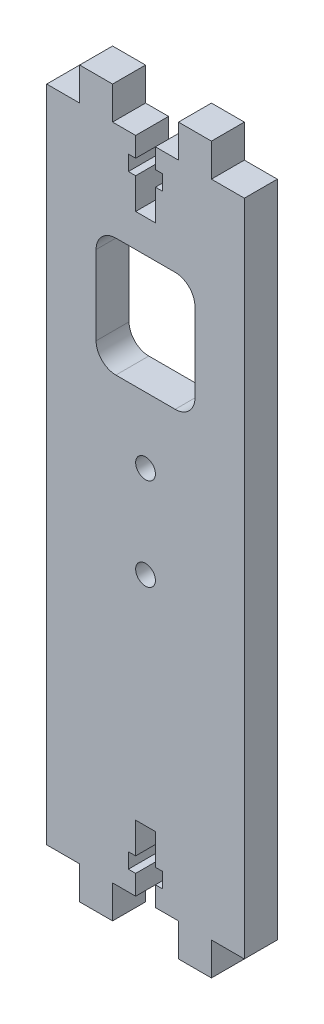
ISO-10303-21;
HEADER;
FILE_DESCRIPTION(('STEP AP214'),'2;1');
FILE_NAME('part.step','',(''),(''),'','','');
FILE_SCHEMA(('AUTOMOTIVE_DESIGN { 1 0 10303 214 1 1 1 1 }'));
ENDSEC;
DATA;
#1=APPLICATION_CONTEXT('core data for automotive mechanical design processes');
#2=APPLICATION_PROTOCOL_DEFINITION('international standard','automotive_design',2000,#1);
#3=PRODUCT_CONTEXT('',#1,'mechanical');
#4=PRODUCT('Part','Part','',(#3));
#5=PRODUCT_RELATED_PRODUCT_CATEGORY('part','',(#4));
#6=PRODUCT_DEFINITION_FORMATION('','',#4);
#7=PRODUCT_DEFINITION_CONTEXT('part definition',#1,'design');
#8=PRODUCT_DEFINITION('design','',#6,#7);
#9=PRODUCT_DEFINITION_SHAPE('','',#8);
#10=(LENGTH_UNIT() NAMED_UNIT(*) SI_UNIT(.MILLI.,.METRE.));
#11=(NAMED_UNIT(*) PLANE_ANGLE_UNIT() SI_UNIT($,.RADIAN.));
#12=(NAMED_UNIT(*) SI_UNIT($,.STERADIAN.) SOLID_ANGLE_UNIT());
#13=UNCERTAINTY_MEASURE_WITH_UNIT(LENGTH_MEASURE(1.E-05),#10,'distance_accuracy_value','');
#14=(GEOMETRIC_REPRESENTATION_CONTEXT(3) GLOBAL_UNCERTAINTY_ASSIGNED_CONTEXT((#13)) GLOBAL_UNIT_ASSIGNED_CONTEXT((#10,
#11,#12)) REPRESENTATION_CONTEXT('',''));
#15=CARTESIAN_POINT('',(0.,0.,0.));
#16=DIRECTION('',(0.,0.,1.));
#17=DIRECTION('',(1.,0.,0.));
#18=AXIS2_PLACEMENT_3D('',#15,#16,#17);
#19=CARTESIAN_POINT('',(0.,0.,5.));
#20=DIRECTION('',(0.,0.,-1.));
#21=DIRECTION('',(-1.,0.,0.));
#22=AXIS2_PLACEMENT_3D('',#19,#20,#21);
#23=PLANE('',#22);
#24=CARTESIAN_POINT('',(0.,43.,5.));
#25=DIRECTION('',(0.,0.,1.));
#26=DIRECTION('',(1.,0.,0.));
#27=AXIS2_PLACEMENT_3D('',#24,#25,#26);
#28=CIRCLE('',#27,1.5);
#29=CARTESIAN_POINT('',(1.5,43.,5.));
#30=VERTEX_POINT('',#29);
#31=EDGE_CURVE('E465',#30,#30,#28,.T.);
#32=ORIENTED_EDGE('',*,*,#31,.F.);
#33=EDGE_LOOP('',(#32));
#34=FACE_BOUND('',#33,.T.);
#35=CARTESIAN_POINT('',(0.,57.,5.));
#36=DIRECTION('',(0.,0.,1.));
#37=DIRECTION('',(1.,0.,0.));
#38=AXIS2_PLACEMENT_3D('',#35,#36,#37);
#39=CIRCLE('',#38,1.5);
#40=CARTESIAN_POINT('',(1.5,57.,5.));
#41=VERTEX_POINT('',#40);
#42=EDGE_CURVE('E471',#41,#41,#39,.T.);
#43=ORIENTED_EDGE('',*,*,#42,.F.);
#44=EDGE_LOOP('',(#43));
#45=FACE_BOUND('',#44,.T.);
#46=DIRECTION('',(-1.,0.,0.));
#47=VECTOR('',#46,1.);
#48=CARTESIAN_POINT('',(-9.99999999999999,100.,5.));
#49=LINE('',#48,#47);
#50=CARTESIAN_POINT('',(-9.99999999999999,100.,5.));
#51=VERTEX_POINT('',#50);
#52=CARTESIAN_POINT('',(-15.,100.,5.));
#53=VERTEX_POINT('',#52);
#54=EDGE_CURVE('E381',#51,#53,#49,.T.);
#55=ORIENTED_EDGE('',*,*,#54,.T.);
#56=DIRECTION('',(0.,-1.,0.));
#57=VECTOR('',#56,1.);
#58=CARTESIAN_POINT('',(-15.,0.,5.));
#59=LINE('',#58,#57);
#60=CARTESIAN_POINT('',(-15.,0.,5.));
#61=VERTEX_POINT('',#60);
#62=EDGE_CURVE('E370',#53,#61,#59,.T.);
#63=ORIENTED_EDGE('',*,*,#62,.T.);
#64=DIRECTION('',(1.,0.,0.));
#65=VECTOR('',#64,1.);
#66=CARTESIAN_POINT('',(-10.,0.,5.));
#67=LINE('',#66,#65);
#68=CARTESIAN_POINT('',(-10.,0.,5.));
#69=VERTEX_POINT('',#68);
#70=EDGE_CURVE('E380',#61,#69,#67,.T.);
#71=ORIENTED_EDGE('',*,*,#70,.T.);
#72=DIRECTION('',(0.,-1.,0.));
#73=VECTOR('',#72,1.);
#74=CARTESIAN_POINT('',(-10.,-5.,5.));
#75=LINE('',#74,#73);
#76=CARTESIAN_POINT('',(-10.,-5.,5.));
#77=VERTEX_POINT('',#76);
#78=EDGE_CURVE('E477',#69,#77,#75,.T.);
#79=ORIENTED_EDGE('',*,*,#78,.T.);
#80=DIRECTION('',(1.,0.,0.));
#81=VECTOR('',#80,1.);
#82=CARTESIAN_POINT('',(-5.,-5.,5.));
#83=LINE('',#82,#81);
#84=CARTESIAN_POINT('',(-5.,-5.,5.));
#85=VERTEX_POINT('',#84);
#86=EDGE_CURVE('E479',#77,#85,#83,.T.);
#87=ORIENTED_EDGE('',*,*,#86,.T.);
#88=DIRECTION('',(0.,1.,0.));
#89=VECTOR('',#88,1.);
#90=CARTESIAN_POINT('',(-5.,-5.,5.));
#91=LINE('',#90,#89);
#92=CARTESIAN_POINT('',(-5.,0.,5.));
#93=VERTEX_POINT('',#92);
#94=EDGE_CURVE('E481',#85,#93,#91,.T.);
#95=ORIENTED_EDGE('',*,*,#94,.T.);
#96=DIRECTION('',(1.,0.,0.));
#97=VECTOR('',#96,1.);
#98=CARTESIAN_POINT('',(-1.5,0.,5.));
#99=LINE('',#98,#97);
#100=CARTESIAN_POINT('',(-1.5,0.,5.));
#101=VERTEX_POINT('',#100);
#102=EDGE_CURVE('E483',#93,#101,#99,.T.);
#103=ORIENTED_EDGE('',*,*,#102,.T.);
#104=DIRECTION('',(0.,1.,0.));
#105=VECTOR('',#104,1.);
#106=CARTESIAN_POINT('',(-1.5,3.,5.));
#107=LINE('',#106,#105);
#108=CARTESIAN_POINT('',(-1.5,3.,5.));
#109=VERTEX_POINT('',#108);
#110=EDGE_CURVE('E485',#101,#109,#107,.T.);
#111=ORIENTED_EDGE('',*,*,#110,.T.);
#112=DIRECTION('',(-1.,0.,0.));
#113=VECTOR('',#112,1.);
#114=CARTESIAN_POINT('',(-1.5,3.,5.));
#115=LINE('',#114,#113);
#116=CARTESIAN_POINT('',(-2.6,3.,5.));
#117=VERTEX_POINT('',#116);
#118=EDGE_CURVE('E487',#109,#117,#115,.T.);
#119=ORIENTED_EDGE('',*,*,#118,.T.);
#120=DIRECTION('',(0.,1.,0.));
#121=VECTOR('',#120,1.);
#122=CARTESIAN_POINT('',(-2.6,3.,5.));
#123=LINE('',#122,#121);
#124=CARTESIAN_POINT('',(-2.6,5.3,5.));
#125=VERTEX_POINT('',#124);
#126=EDGE_CURVE('E489',#117,#125,#123,.T.);
#127=ORIENTED_EDGE('',*,*,#126,.T.);
#128=DIRECTION('',(1.,0.,0.));
#129=VECTOR('',#128,1.);
#130=CARTESIAN_POINT('',(-2.6,5.3,5.));
#131=LINE('',#130,#129);
#132=CARTESIAN_POINT('',(-1.5,5.3,5.));
#133=VERTEX_POINT('',#132);
#134=EDGE_CURVE('E491',#125,#133,#131,.T.);
#135=ORIENTED_EDGE('',*,*,#134,.T.);
#136=DIRECTION('',(0.,1.,0.));
#137=VECTOR('',#136,1.);
#138=CARTESIAN_POINT('',(-1.5,10.,5.));
#139=LINE('',#138,#137);
#140=CARTESIAN_POINT('',(-1.5,10.,5.));
#141=VERTEX_POINT('',#140);
#142=EDGE_CURVE('E493',#133,#141,#139,.T.);
#143=ORIENTED_EDGE('',*,*,#142,.T.);
#144=DIRECTION('',(1.,0.,0.));
#145=VECTOR('',#144,1.);
#146=CARTESIAN_POINT('',(1.5,10.,5.));
#147=LINE('',#146,#145);
#148=CARTESIAN_POINT('',(1.5,10.,5.));
#149=VERTEX_POINT('',#148);
#150=EDGE_CURVE('E495',#141,#149,#147,.T.);
#151=ORIENTED_EDGE('',*,*,#150,.T.);
#152=DIRECTION('',(0.,-1.,0.));
#153=VECTOR('',#152,1.);
#154=CARTESIAN_POINT('',(1.5,5.3,5.));
#155=LINE('',#154,#153);
#156=CARTESIAN_POINT('',(1.5,5.3,5.));
#157=VERTEX_POINT('',#156);
#158=EDGE_CURVE('E497',#149,#157,#155,.T.);
#159=ORIENTED_EDGE('',*,*,#158,.T.);
#160=DIRECTION('',(1.,0.,0.));
#161=VECTOR('',#160,1.);
#162=CARTESIAN_POINT('',(1.5,5.3,5.));
#163=LINE('',#162,#161);
#164=CARTESIAN_POINT('',(2.6,5.3,5.));
#165=VERTEX_POINT('',#164);
#166=EDGE_CURVE('E499',#157,#165,#163,.T.);
#167=ORIENTED_EDGE('',*,*,#166,.T.);
#168=DIRECTION('',(0.,-1.,0.));
#169=VECTOR('',#168,1.);
#170=CARTESIAN_POINT('',(2.6,5.3,5.));
#171=LINE('',#170,#169);
#172=CARTESIAN_POINT('',(2.6,3.,5.));
#173=VERTEX_POINT('',#172);
#174=EDGE_CURVE('E501',#165,#173,#171,.T.);
#175=ORIENTED_EDGE('',*,*,#174,.T.);
#176=DIRECTION('',(-1.,0.,0.));
#177=VECTOR('',#176,1.);
#178=CARTESIAN_POINT('',(2.6,3.,5.));
#179=LINE('',#178,#177);
#180=CARTESIAN_POINT('',(1.5,3.,5.));
#181=VERTEX_POINT('',#180);
#182=EDGE_CURVE('E503',#173,#181,#179,.T.);
#183=ORIENTED_EDGE('',*,*,#182,.T.);
#184=DIRECTION('',(0.,-1.,0.));
#185=VECTOR('',#184,1.);
#186=CARTESIAN_POINT('',(1.5,0.,5.));
#187=LINE('',#186,#185);
#188=CARTESIAN_POINT('',(1.5,0.,5.));
#189=VERTEX_POINT('',#188);
#190=EDGE_CURVE('E505',#181,#189,#187,.T.);
#191=ORIENTED_EDGE('',*,*,#190,.T.);
#192=DIRECTION('',(1.,0.,0.));
#193=VECTOR('',#192,1.);
#194=CARTESIAN_POINT('',(1.5,0.,5.));
#195=LINE('',#194,#193);
#196=CARTESIAN_POINT('',(5.,0.,5.));
#197=VERTEX_POINT('',#196);
#198=EDGE_CURVE('E507',#189,#197,#195,.T.);
#199=ORIENTED_EDGE('',*,*,#198,.T.);
#200=DIRECTION('',(0.,-1.,0.));
#201=VECTOR('',#200,1.);
#202=CARTESIAN_POINT('',(5.,0.,5.));
#203=LINE('',#202,#201);
#204=CARTESIAN_POINT('',(5.,-5.,5.));
#205=VERTEX_POINT('',#204);
#206=EDGE_CURVE('E509',#197,#205,#203,.T.);
#207=ORIENTED_EDGE('',*,*,#206,.T.);
#208=DIRECTION('',(1.,0.,0.));
#209=VECTOR('',#208,1.);
#210=CARTESIAN_POINT('',(5.,-5.,5.));
#211=LINE('',#210,#209);
#212=CARTESIAN_POINT('',(10.,-5.,5.));
#213=VERTEX_POINT('',#212);
#214=EDGE_CURVE('E511',#205,#213,#211,.T.);
#215=ORIENTED_EDGE('',*,*,#214,.T.);
#216=DIRECTION('',(0.,1.,0.));
#217=VECTOR('',#216,1.);
#218=CARTESIAN_POINT('',(10.,-5.,5.));
#219=LINE('',#218,#217);
#220=CARTESIAN_POINT('',(10.,0.,5.));
#221=VERTEX_POINT('',#220);
#222=EDGE_CURVE('E513',#213,#221,#219,.T.);
#223=ORIENTED_EDGE('',*,*,#222,.T.);
#224=DIRECTION('',(1.,0.,0.));
#225=VECTOR('',#224,1.);
#226=CARTESIAN_POINT('',(15.,0.,5.));
#227=LINE('',#226,#225);
#228=CARTESIAN_POINT('',(15.,0.,5.));
#229=VERTEX_POINT('',#228);
#230=EDGE_CURVE('E515',#221,#229,#227,.T.);
#231=ORIENTED_EDGE('',*,*,#230,.T.);
#232=DIRECTION('',(0.,1.,0.));
#233=VECTOR('',#232,1.);
#234=CARTESIAN_POINT('',(15.,100.,5.));
#235=LINE('',#234,#233);
#236=CARTESIAN_POINT('',(15.,100.,5.));
#237=VERTEX_POINT('',#236);
#238=EDGE_CURVE('E517',#229,#237,#235,.T.);
#239=ORIENTED_EDGE('',*,*,#238,.T.);
#240=DIRECTION('',(-1.,0.,0.));
#241=VECTOR('',#240,1.);
#242=CARTESIAN_POINT('',(9.99999999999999,100.,5.));
#243=LINE('',#242,#241);
#244=CARTESIAN_POINT('',(9.99999999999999,100.,5.));
#245=VERTEX_POINT('',#244);
#246=EDGE_CURVE('E519',#237,#245,#243,.T.);
#247=ORIENTED_EDGE('',*,*,#246,.T.);
#248=DIRECTION('',(0.,1.,0.));
#249=VECTOR('',#248,1.);
#250=CARTESIAN_POINT('',(9.99999999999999,105.,5.));
#251=LINE('',#250,#249);
#252=CARTESIAN_POINT('',(9.99999999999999,105.,5.));
#253=VERTEX_POINT('',#252);
#254=EDGE_CURVE('E521',#245,#253,#251,.T.);
#255=ORIENTED_EDGE('',*,*,#254,.T.);
#256=DIRECTION('',(-1.,0.,0.));
#257=VECTOR('',#256,1.);
#258=CARTESIAN_POINT('',(4.99999999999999,105.,5.));
#259=LINE('',#258,#257);
#260=CARTESIAN_POINT('',(4.99999999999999,105.,5.));
#261=VERTEX_POINT('',#260);
#262=EDGE_CURVE('E523',#253,#261,#259,.T.);
#263=ORIENTED_EDGE('',*,*,#262,.T.);
#264=DIRECTION('',(0.,-1.,0.));
#265=VECTOR('',#264,1.);
#266=CARTESIAN_POINT('',(4.99999999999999,105.,5.));
#267=LINE('',#266,#265);
#268=CARTESIAN_POINT('',(4.99999999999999,100.,5.));
#269=VERTEX_POINT('',#268);
#270=EDGE_CURVE('E525',#261,#269,#267,.T.);
#271=ORIENTED_EDGE('',*,*,#270,.T.);
#272=DIRECTION('',(-1.,0.,0.));
#273=VECTOR('',#272,1.);
#274=CARTESIAN_POINT('',(1.5,100.,5.));
#275=LINE('',#274,#273);
#276=CARTESIAN_POINT('',(1.5,100.,5.));
#277=VERTEX_POINT('',#276);
#278=EDGE_CURVE('E527',#269,#277,#275,.T.);
#279=ORIENTED_EDGE('',*,*,#278,.T.);
#280=DIRECTION('',(0.,-1.,0.));
#281=VECTOR('',#280,1.);
#282=CARTESIAN_POINT('',(1.5,97.,5.));
#283=LINE('',#282,#281);
#284=CARTESIAN_POINT('',(1.5,97.,5.));
#285=VERTEX_POINT('',#284);
#286=EDGE_CURVE('E529',#277,#285,#283,.T.);
#287=ORIENTED_EDGE('',*,*,#286,.T.);
#288=DIRECTION('',(1.,0.,0.));
#289=VECTOR('',#288,1.);
#290=CARTESIAN_POINT('',(1.5,97.,5.));
#291=LINE('',#290,#289);
#292=CARTESIAN_POINT('',(2.60000000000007,97.,5.));
#293=VERTEX_POINT('',#292);
#294=EDGE_CURVE('E531',#285,#293,#291,.T.);
#295=ORIENTED_EDGE('',*,*,#294,.T.);
#296=DIRECTION('',(0.,-1.,0.));
#297=VECTOR('',#296,1.);
#298=CARTESIAN_POINT('',(2.60000000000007,97.,5.));
#299=LINE('',#298,#297);
#300=CARTESIAN_POINT('',(2.60000000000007,94.7,5.));
#301=VERTEX_POINT('',#300);
#302=EDGE_CURVE('E533',#293,#301,#299,.T.);
#303=ORIENTED_EDGE('',*,*,#302,.T.);
#304=DIRECTION('',(-1.,0.,0.));
#305=VECTOR('',#304,1.);
#306=CARTESIAN_POINT('',(2.60000000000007,94.7,5.));
#307=LINE('',#306,#305);
#308=CARTESIAN_POINT('',(1.5,94.7,5.));
#309=VERTEX_POINT('',#308);
#310=EDGE_CURVE('E535',#301,#309,#307,.T.);
#311=ORIENTED_EDGE('',*,*,#310,.T.);
#312=DIRECTION('',(0.,-1.,0.));
#313=VECTOR('',#312,1.);
#314=CARTESIAN_POINT('',(1.5,90.,5.));
#315=LINE('',#314,#313);
#316=CARTESIAN_POINT('',(1.5,90.,5.));
#317=VERTEX_POINT('',#316);
#318=EDGE_CURVE('E537',#309,#317,#315,.T.);
#319=ORIENTED_EDGE('',*,*,#318,.T.);
#320=DIRECTION('',(-1.,0.,0.));
#321=VECTOR('',#320,1.);
#322=CARTESIAN_POINT('',(-1.5,90.,5.));
#323=LINE('',#322,#321);
#324=CARTESIAN_POINT('',(-1.5,90.,5.));
#325=VERTEX_POINT('',#324);
#326=EDGE_CURVE('E539',#317,#325,#323,.T.);
#327=ORIENTED_EDGE('',*,*,#326,.T.);
#328=DIRECTION('',(0.,1.,0.));
#329=VECTOR('',#328,1.);
#330=CARTESIAN_POINT('',(-1.5,94.7,5.));
#331=LINE('',#330,#329);
#332=CARTESIAN_POINT('',(-1.5,94.7,5.));
#333=VERTEX_POINT('',#332);
#334=EDGE_CURVE('E541',#325,#333,#331,.T.);
#335=ORIENTED_EDGE('',*,*,#334,.T.);
#336=DIRECTION('',(-1.,0.,0.));
#337=VECTOR('',#336,1.);
#338=CARTESIAN_POINT('',(-1.5,94.7,5.));
#339=LINE('',#338,#337);
#340=CARTESIAN_POINT('',(-2.60000000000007,94.7,5.));
#341=VERTEX_POINT('',#340);
#342=EDGE_CURVE('E543',#333,#341,#339,.T.);
#343=ORIENTED_EDGE('',*,*,#342,.T.);
#344=DIRECTION('',(0.,1.,0.));
#345=VECTOR('',#344,1.);
#346=CARTESIAN_POINT('',(-2.60000000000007,94.7,5.));
#347=LINE('',#346,#345);
#348=CARTESIAN_POINT('',(-2.60000000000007,97.,5.));
#349=VERTEX_POINT('',#348);
#350=EDGE_CURVE('E545',#341,#349,#347,.T.);
#351=ORIENTED_EDGE('',*,*,#350,.T.);
#352=DIRECTION('',(1.,0.,0.));
#353=VECTOR('',#352,1.);
#354=CARTESIAN_POINT('',(-2.60000000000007,97.,5.));
#355=LINE('',#354,#353);
#356=CARTESIAN_POINT('',(-1.5,97.,5.));
#357=VERTEX_POINT('',#356);
#358=EDGE_CURVE('E547',#349,#357,#355,.T.);
#359=ORIENTED_EDGE('',*,*,#358,.T.);
#360=DIRECTION('',(0.,1.,0.));
#361=VECTOR('',#360,1.);
#362=CARTESIAN_POINT('',(-1.5,100.,5.));
#363=LINE('',#362,#361);
#364=CARTESIAN_POINT('',(-1.5,100.,5.));
#365=VERTEX_POINT('',#364);
#366=EDGE_CURVE('E549',#357,#365,#363,.T.);
#367=ORIENTED_EDGE('',*,*,#366,.T.);
#368=DIRECTION('',(-1.,0.,0.));
#369=VECTOR('',#368,1.);
#370=CARTESIAN_POINT('',(-1.5,100.,5.));
#371=LINE('',#370,#369);
#372=CARTESIAN_POINT('',(-4.99999999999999,100.,5.));
#373=VERTEX_POINT('',#372);
#374=EDGE_CURVE('E551',#365,#373,#371,.T.);
#375=ORIENTED_EDGE('',*,*,#374,.T.);
#376=DIRECTION('',(0.,1.,0.));
#377=VECTOR('',#376,1.);
#378=CARTESIAN_POINT('',(-4.99999999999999,100.,5.));
#379=LINE('',#378,#377);
#380=CARTESIAN_POINT('',(-4.99999999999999,105.,5.));
#381=VERTEX_POINT('',#380);
#382=EDGE_CURVE('E553',#373,#381,#379,.T.);
#383=ORIENTED_EDGE('',*,*,#382,.T.);
#384=DIRECTION('',(-1.,0.,0.));
#385=VECTOR('',#384,1.);
#386=CARTESIAN_POINT('',(-4.99999999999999,105.,5.));
#387=LINE('',#386,#385);
#388=CARTESIAN_POINT('',(-9.99999999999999,105.,5.));
#389=VERTEX_POINT('',#388);
#390=EDGE_CURVE('E555',#381,#389,#387,.T.);
#391=ORIENTED_EDGE('',*,*,#390,.T.);
#392=DIRECTION('',(0.,-1.,0.));
#393=VECTOR('',#392,1.);
#394=CARTESIAN_POINT('',(-9.99999999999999,105.,5.));
#395=LINE('',#394,#393);
#396=EDGE_CURVE('E385',#389,#51,#395,.T.);
#397=ORIENTED_EDGE('',*,*,#396,.T.);
#398=EDGE_LOOP('',(#55,#63,#71,#79,#87,#95,#103,#111,#119,#127,#135,#143,#151,#159,#167,#175,
#183,#191,#199,#207,#215,#223,#231,#239,#247,#255,#263,#271,#279,#287,#295,#303,#311,#319,#327,
#335,#343,#351,#359,#367,#375,#383,#391,#397));
#399=FACE_BOUND('',#398,.T.);
#400=DIRECTION('',(0.,-1.,0.));
#401=VECTOR('',#400,1.);
#402=CARTESIAN_POINT('',(-7.5,85.,5.));
#403=LINE('',#402,#401);
#404=CARTESIAN_POINT('',(-7.5,82.,5.));
#405=VERTEX_POINT('',#404);
#406=CARTESIAN_POINT('',(-7.5,70.,5.));
#407=VERTEX_POINT('',#406);
#408=EDGE_CURVE('E439',#405,#407,#403,.T.);
#409=ORIENTED_EDGE('',*,*,#408,.F.);
#410=CARTESIAN_POINT('',(-4.5,82.,5.));
#411=DIRECTION('',(0.,0.,-1.));
#412=DIRECTION('',(-1.,0.,0.));
#413=AXIS2_PLACEMENT_3D('',#410,#411,#412);
#414=CIRCLE('',#413,3.);
#415=CARTESIAN_POINT('',(-4.5,85.,5.));
#416=VERTEX_POINT('',#415);
#417=EDGE_CURVE('E55',#405,#416,#414,.T.);
#418=ORIENTED_EDGE('',*,*,#417,.T.);
#419=DIRECTION('',(-1.,0.,0.));
#420=VECTOR('',#419,1.);
#421=CARTESIAN_POINT('',(-7.5,85.,5.));
#422=LINE('',#421,#420);
#423=CARTESIAN_POINT('',(4.5,85.,5.));
#424=VERTEX_POINT('',#423);
#425=EDGE_CURVE('E446',#424,#416,#422,.T.);
#426=ORIENTED_EDGE('',*,*,#425,.F.);
#427=CARTESIAN_POINT('',(4.5,82.,5.));
#428=DIRECTION('',(0.,0.,-1.));
#429=DIRECTION('',(-1.,0.,0.));
#430=AXIS2_PLACEMENT_3D('',#427,#428,#429);
#431=CIRCLE('',#430,3.);
#432=CARTESIAN_POINT('',(7.5,82.,5.));
#433=VERTEX_POINT('',#432);
#434=EDGE_CURVE('E11',#424,#433,#431,.T.);
#435=ORIENTED_EDGE('',*,*,#434,.T.);
#436=DIRECTION('',(0.,1.,0.));
#437=VECTOR('',#436,1.);
#438=CARTESIAN_POINT('',(7.5,85.,5.));
#439=LINE('',#438,#437);
#440=CARTESIAN_POINT('',(7.5,70.,5.));
#441=VERTEX_POINT('',#440);
#442=EDGE_CURVE('E444',#441,#433,#439,.T.);
#443=ORIENTED_EDGE('',*,*,#442,.F.);
#444=CARTESIAN_POINT('',(4.5,70.,5.));
#445=DIRECTION('',(0.,0.,-1.));
#446=DIRECTION('',(-1.,0.,0.));
#447=AXIS2_PLACEMENT_3D('',#444,#445,#446);
#448=CIRCLE('',#447,3.);
#449=CARTESIAN_POINT('',(4.5,67.,5.));
#450=VERTEX_POINT('',#449);
#451=EDGE_CURVE('E420',#441,#450,#448,.T.);
#452=ORIENTED_EDGE('',*,*,#451,.T.);
#453=DIRECTION('',(1.,0.,0.));
#454=VECTOR('',#453,1.);
#455=CARTESIAN_POINT('',(-7.5,67.,5.));
#456=LINE('',#455,#454);
#457=CARTESIAN_POINT('',(-4.5,67.,5.));
#458=VERTEX_POINT('',#457);
#459=EDGE_CURVE('E450',#458,#450,#456,.T.);
#460=ORIENTED_EDGE('',*,*,#459,.F.);
#461=CARTESIAN_POINT('',(-4.5,70.,5.));
#462=DIRECTION('',(0.,0.,-1.));
#463=DIRECTION('',(-1.,0.,0.));
#464=AXIS2_PLACEMENT_3D('',#461,#462,#463);
#465=CIRCLE('',#464,3.);
#466=EDGE_CURVE('E424',#458,#407,#465,.T.);
#467=ORIENTED_EDGE('',*,*,#466,.T.);
#468=EDGE_LOOP('',(#409,#418,#426,#435,#443,#452,#460,#467));
#469=FACE_BOUND('',#468,.T.);
#470=ADVANCED_FACE('F40',(#34,#45,#399,#469),#23,.F.);
#471=CARTESIAN_POINT('',(0.,0.,0.));
#472=DIRECTION('',(0.,0.,-1.));
#473=DIRECTION('',(-1.,0.,0.));
#474=AXIS2_PLACEMENT_3D('',#471,#472,#473);
#475=PLANE('',#474);
#476=CARTESIAN_POINT('',(0.,57.,0.));
#477=DIRECTION('',(0.,0.,1.));
#478=DIRECTION('',(1.,0.,0.));
#479=AXIS2_PLACEMENT_3D('',#476,#477,#478);
#480=CIRCLE('',#479,1.5);
#481=CARTESIAN_POINT('',(1.5,57.,0.));
#482=VERTEX_POINT('',#481);
#483=EDGE_CURVE('E468',#482,#482,#480,.T.);
#484=ORIENTED_EDGE('',*,*,#483,.T.);
#485=EDGE_LOOP('',(#484));
#486=FACE_BOUND('',#485,.T.);
#487=DIRECTION('',(-1.,0.,0.));
#488=VECTOR('',#487,1.);
#489=CARTESIAN_POINT('',(-9.99999999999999,100.,0.));
#490=LINE('',#489,#488);
#491=CARTESIAN_POINT('',(-9.99999999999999,100.,0.));
#492=VERTEX_POINT('',#491);
#493=CARTESIAN_POINT('',(-15.,100.,0.));
#494=VERTEX_POINT('',#493);
#495=EDGE_CURVE('E393',#492,#494,#490,.T.);
#496=ORIENTED_EDGE('',*,*,#495,.F.);
#497=DIRECTION('',(0.,-1.,0.));
#498=VECTOR('',#497,1.);
#499=CARTESIAN_POINT('',(-9.99999999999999,105.,0.));
#500=LINE('',#499,#498);
#501=CARTESIAN_POINT('',(-9.99999999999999,105.,0.));
#502=VERTEX_POINT('',#501);
#503=EDGE_CURVE('E389',#502,#492,#500,.T.);
#504=ORIENTED_EDGE('',*,*,#503,.F.);
#505=DIRECTION('',(-1.,0.,0.));
#506=VECTOR('',#505,1.);
#507=CARTESIAN_POINT('',(-4.99999999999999,105.,0.));
#508=LINE('',#507,#506);
#509=CARTESIAN_POINT('',(-4.99999999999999,105.,0.));
#510=VERTEX_POINT('',#509);
#511=EDGE_CURVE('E642',#510,#502,#508,.T.);
#512=ORIENTED_EDGE('',*,*,#511,.F.);
#513=DIRECTION('',(0.,1.,0.));
#514=VECTOR('',#513,1.);
#515=CARTESIAN_POINT('',(-4.99999999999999,100.,0.));
#516=LINE('',#515,#514);
#517=CARTESIAN_POINT('',(-4.99999999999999,100.,0.));
#518=VERTEX_POINT('',#517);
#519=EDGE_CURVE('E640',#518,#510,#516,.T.);
#520=ORIENTED_EDGE('',*,*,#519,.F.);
#521=DIRECTION('',(-1.,0.,0.));
#522=VECTOR('',#521,1.);
#523=CARTESIAN_POINT('',(-1.5,100.,0.));
#524=LINE('',#523,#522);
#525=CARTESIAN_POINT('',(-1.5,100.,0.));
#526=VERTEX_POINT('',#525);
#527=EDGE_CURVE('E638',#526,#518,#524,.T.);
#528=ORIENTED_EDGE('',*,*,#527,.F.);
#529=DIRECTION('',(0.,1.,0.));
#530=VECTOR('',#529,1.);
#531=CARTESIAN_POINT('',(-1.5,100.,0.));
#532=LINE('',#531,#530);
#533=CARTESIAN_POINT('',(-1.5,97.,0.));
#534=VERTEX_POINT('',#533);
#535=EDGE_CURVE('E636',#534,#526,#532,.T.);
#536=ORIENTED_EDGE('',*,*,#535,.F.);
#537=DIRECTION('',(1.,0.,0.));
#538=VECTOR('',#537,1.);
#539=CARTESIAN_POINT('',(-2.60000000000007,97.,0.));
#540=LINE('',#539,#538);
#541=CARTESIAN_POINT('',(-2.60000000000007,97.,0.));
#542=VERTEX_POINT('',#541);
#543=EDGE_CURVE('E634',#542,#534,#540,.T.);
#544=ORIENTED_EDGE('',*,*,#543,.F.);
#545=DIRECTION('',(0.,1.,0.));
#546=VECTOR('',#545,1.);
#547=CARTESIAN_POINT('',(-2.60000000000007,94.7,0.));
#548=LINE('',#547,#546);
#549=CARTESIAN_POINT('',(-2.60000000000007,94.7,0.));
#550=VERTEX_POINT('',#549);
#551=EDGE_CURVE('E632',#550,#542,#548,.T.);
#552=ORIENTED_EDGE('',*,*,#551,.F.);
#553=DIRECTION('',(-1.,0.,0.));
#554=VECTOR('',#553,1.);
#555=CARTESIAN_POINT('',(-1.5,94.7,0.));
#556=LINE('',#555,#554);
#557=CARTESIAN_POINT('',(-1.5,94.7,0.));
#558=VERTEX_POINT('',#557);
#559=EDGE_CURVE('E630',#558,#550,#556,.T.);
#560=ORIENTED_EDGE('',*,*,#559,.F.);
#561=DIRECTION('',(0.,1.,0.));
#562=VECTOR('',#561,1.);
#563=CARTESIAN_POINT('',(-1.5,94.7,0.));
#564=LINE('',#563,#562);
#565=CARTESIAN_POINT('',(-1.5,90.,0.));
#566=VERTEX_POINT('',#565);
#567=EDGE_CURVE('E628',#566,#558,#564,.T.);
#568=ORIENTED_EDGE('',*,*,#567,.F.);
#569=DIRECTION('',(-1.,0.,0.));
#570=VECTOR('',#569,1.);
#571=CARTESIAN_POINT('',(-1.5,90.,0.));
#572=LINE('',#571,#570);
#573=CARTESIAN_POINT('',(1.5,90.,0.));
#574=VERTEX_POINT('',#573);
#575=EDGE_CURVE('E626',#574,#566,#572,.T.);
#576=ORIENTED_EDGE('',*,*,#575,.F.);
#577=DIRECTION('',(0.,-1.,0.));
#578=VECTOR('',#577,1.);
#579=CARTESIAN_POINT('',(1.5,90.,0.));
#580=LINE('',#579,#578);
#581=CARTESIAN_POINT('',(1.5,94.7,0.));
#582=VERTEX_POINT('',#581);
#583=EDGE_CURVE('E624',#582,#574,#580,.T.);
#584=ORIENTED_EDGE('',*,*,#583,.F.);
#585=DIRECTION('',(-1.,0.,0.));
#586=VECTOR('',#585,1.);
#587=CARTESIAN_POINT('',(2.60000000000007,94.7,0.));
#588=LINE('',#587,#586);
#589=CARTESIAN_POINT('',(2.60000000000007,94.7,0.));
#590=VERTEX_POINT('',#589);
#591=EDGE_CURVE('E622',#590,#582,#588,.T.);
#592=ORIENTED_EDGE('',*,*,#591,.F.);
#593=DIRECTION('',(0.,-1.,0.));
#594=VECTOR('',#593,1.);
#595=CARTESIAN_POINT('',(2.60000000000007,97.,0.));
#596=LINE('',#595,#594);
#597=CARTESIAN_POINT('',(2.60000000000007,97.,0.));
#598=VERTEX_POINT('',#597);
#599=EDGE_CURVE('E620',#598,#590,#596,.T.);
#600=ORIENTED_EDGE('',*,*,#599,.F.);
#601=DIRECTION('',(1.,0.,0.));
#602=VECTOR('',#601,1.);
#603=CARTESIAN_POINT('',(1.5,97.,0.));
#604=LINE('',#603,#602);
#605=CARTESIAN_POINT('',(1.5,97.,0.));
#606=VERTEX_POINT('',#605);
#607=EDGE_CURVE('E618',#606,#598,#604,.T.);
#608=ORIENTED_EDGE('',*,*,#607,.F.);
#609=DIRECTION('',(0.,-1.,0.));
#610=VECTOR('',#609,1.);
#611=CARTESIAN_POINT('',(1.5,97.,0.));
#612=LINE('',#611,#610);
#613=CARTESIAN_POINT('',(1.5,100.,0.));
#614=VERTEX_POINT('',#613);
#615=EDGE_CURVE('E616',#614,#606,#612,.T.);
#616=ORIENTED_EDGE('',*,*,#615,.F.);
#617=DIRECTION('',(-1.,0.,0.));
#618=VECTOR('',#617,1.);
#619=CARTESIAN_POINT('',(1.5,100.,0.));
#620=LINE('',#619,#618);
#621=CARTESIAN_POINT('',(4.99999999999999,100.,0.));
#622=VERTEX_POINT('',#621);
#623=EDGE_CURVE('E614',#622,#614,#620,.T.);
#624=ORIENTED_EDGE('',*,*,#623,.F.);
#625=DIRECTION('',(0.,-1.,0.));
#626=VECTOR('',#625,1.);
#627=CARTESIAN_POINT('',(4.99999999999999,105.,0.));
#628=LINE('',#627,#626);
#629=CARTESIAN_POINT('',(4.99999999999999,105.,0.));
#630=VERTEX_POINT('',#629);
#631=EDGE_CURVE('E612',#630,#622,#628,.T.);
#632=ORIENTED_EDGE('',*,*,#631,.F.);
#633=DIRECTION('',(-1.,0.,0.));
#634=VECTOR('',#633,1.);
#635=CARTESIAN_POINT('',(4.99999999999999,105.,0.));
#636=LINE('',#635,#634);
#637=CARTESIAN_POINT('',(9.99999999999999,105.,0.));
#638=VERTEX_POINT('',#637);
#639=EDGE_CURVE('E610',#638,#630,#636,.T.);
#640=ORIENTED_EDGE('',*,*,#639,.F.);
#641=DIRECTION('',(0.,1.,0.));
#642=VECTOR('',#641,1.);
#643=CARTESIAN_POINT('',(9.99999999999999,105.,0.));
#644=LINE('',#643,#642);
#645=CARTESIAN_POINT('',(9.99999999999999,100.,0.));
#646=VERTEX_POINT('',#645);
#647=EDGE_CURVE('E608',#646,#638,#644,.T.);
#648=ORIENTED_EDGE('',*,*,#647,.F.);
#649=DIRECTION('',(-1.,0.,0.));
#650=VECTOR('',#649,1.);
#651=CARTESIAN_POINT('',(9.99999999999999,100.,0.));
#652=LINE('',#651,#650);
#653=CARTESIAN_POINT('',(15.,100.,0.));
#654=VERTEX_POINT('',#653);
#655=EDGE_CURVE('E606',#654,#646,#652,.T.);
#656=ORIENTED_EDGE('',*,*,#655,.F.);
#657=DIRECTION('',(0.,1.,0.));
#658=VECTOR('',#657,1.);
#659=CARTESIAN_POINT('',(15.,100.,0.));
#660=LINE('',#659,#658);
#661=CARTESIAN_POINT('',(15.,0.,0.));
#662=VERTEX_POINT('',#661);
#663=EDGE_CURVE('E604',#662,#654,#660,.T.);
#664=ORIENTED_EDGE('',*,*,#663,.F.);
#665=DIRECTION('',(1.,0.,0.));
#666=VECTOR('',#665,1.);
#667=CARTESIAN_POINT('',(15.,0.,0.));
#668=LINE('',#667,#666);
#669=CARTESIAN_POINT('',(10.,0.,0.));
#670=VERTEX_POINT('',#669);
#671=EDGE_CURVE('E602',#670,#662,#668,.T.);
#672=ORIENTED_EDGE('',*,*,#671,.F.);
#673=DIRECTION('',(0.,1.,0.));
#674=VECTOR('',#673,1.);
#675=CARTESIAN_POINT('',(10.,-5.,0.));
#676=LINE('',#675,#674);
#677=CARTESIAN_POINT('',(10.,-5.,0.));
#678=VERTEX_POINT('',#677);
#679=EDGE_CURVE('E600',#678,#670,#676,.T.);
#680=ORIENTED_EDGE('',*,*,#679,.F.);
#681=DIRECTION('',(1.,0.,0.));
#682=VECTOR('',#681,1.);
#683=CARTESIAN_POINT('',(5.,-5.,0.));
#684=LINE('',#683,#682);
#685=CARTESIAN_POINT('',(5.,-5.,0.));
#686=VERTEX_POINT('',#685);
#687=EDGE_CURVE('E598',#686,#678,#684,.T.);
#688=ORIENTED_EDGE('',*,*,#687,.F.);
#689=DIRECTION('',(0.,-1.,0.));
#690=VECTOR('',#689,1.);
#691=CARTESIAN_POINT('',(5.,0.,0.));
#692=LINE('',#691,#690);
#693=CARTESIAN_POINT('',(5.,0.,0.));
#694=VERTEX_POINT('',#693);
#695=EDGE_CURVE('E596',#694,#686,#692,.T.);
#696=ORIENTED_EDGE('',*,*,#695,.F.);
#697=DIRECTION('',(1.,0.,0.));
#698=VECTOR('',#697,1.);
#699=CARTESIAN_POINT('',(1.5,0.,0.));
#700=LINE('',#699,#698);
#701=CARTESIAN_POINT('',(1.5,0.,0.));
#702=VERTEX_POINT('',#701);
#703=EDGE_CURVE('E594',#702,#694,#700,.T.);
#704=ORIENTED_EDGE('',*,*,#703,.F.);
#705=DIRECTION('',(0.,-1.,0.));
#706=VECTOR('',#705,1.);
#707=CARTESIAN_POINT('',(1.5,0.,0.));
#708=LINE('',#707,#706);
#709=CARTESIAN_POINT('',(1.5,3.,0.));
#710=VERTEX_POINT('',#709);
#711=EDGE_CURVE('E592',#710,#702,#708,.T.);
#712=ORIENTED_EDGE('',*,*,#711,.F.);
#713=DIRECTION('',(-1.,0.,0.));
#714=VECTOR('',#713,1.);
#715=CARTESIAN_POINT('',(2.6,3.,0.));
#716=LINE('',#715,#714);
#717=CARTESIAN_POINT('',(2.6,3.,0.));
#718=VERTEX_POINT('',#717);
#719=EDGE_CURVE('E590',#718,#710,#716,.T.);
#720=ORIENTED_EDGE('',*,*,#719,.F.);
#721=DIRECTION('',(0.,-1.,0.));
#722=VECTOR('',#721,1.);
#723=CARTESIAN_POINT('',(2.6,5.3,0.));
#724=LINE('',#723,#722);
#725=CARTESIAN_POINT('',(2.6,5.3,0.));
#726=VERTEX_POINT('',#725);
#727=EDGE_CURVE('E588',#726,#718,#724,.T.);
#728=ORIENTED_EDGE('',*,*,#727,.F.);
#729=DIRECTION('',(1.,0.,0.));
#730=VECTOR('',#729,1.);
#731=CARTESIAN_POINT('',(1.5,5.3,0.));
#732=LINE('',#731,#730);
#733=CARTESIAN_POINT('',(1.5,5.3,0.));
#734=VERTEX_POINT('',#733);
#735=EDGE_CURVE('E586',#734,#726,#732,.T.);
#736=ORIENTED_EDGE('',*,*,#735,.F.);
#737=DIRECTION('',(0.,-1.,0.));
#738=VECTOR('',#737,1.);
#739=CARTESIAN_POINT('',(1.5,5.3,0.));
#740=LINE('',#739,#738);
#741=CARTESIAN_POINT('',(1.5,10.,0.));
#742=VERTEX_POINT('',#741);
#743=EDGE_CURVE('E584',#742,#734,#740,.T.);
#744=ORIENTED_EDGE('',*,*,#743,.F.);
#745=DIRECTION('',(1.,0.,0.));
#746=VECTOR('',#745,1.);
#747=CARTESIAN_POINT('',(1.5,10.,0.));
#748=LINE('',#747,#746);
#749=CARTESIAN_POINT('',(-1.5,10.,0.));
#750=VERTEX_POINT('',#749);
#751=EDGE_CURVE('E582',#750,#742,#748,.T.);
#752=ORIENTED_EDGE('',*,*,#751,.F.);
#753=DIRECTION('',(0.,1.,0.));
#754=VECTOR('',#753,1.);
#755=CARTESIAN_POINT('',(-1.5,10.,0.));
#756=LINE('',#755,#754);
#757=CARTESIAN_POINT('',(-1.5,5.3,0.));
#758=VERTEX_POINT('',#757);
#759=EDGE_CURVE('E580',#758,#750,#756,.T.);
#760=ORIENTED_EDGE('',*,*,#759,.F.);
#761=DIRECTION('',(1.,0.,0.));
#762=VECTOR('',#761,1.);
#763=CARTESIAN_POINT('',(-2.6,5.3,0.));
#764=LINE('',#763,#762);
#765=CARTESIAN_POINT('',(-2.6,5.3,0.));
#766=VERTEX_POINT('',#765);
#767=EDGE_CURVE('E578',#766,#758,#764,.T.);
#768=ORIENTED_EDGE('',*,*,#767,.F.);
#769=DIRECTION('',(0.,1.,0.));
#770=VECTOR('',#769,1.);
#771=CARTESIAN_POINT('',(-2.6,3.,0.));
#772=LINE('',#771,#770);
#773=CARTESIAN_POINT('',(-2.6,3.,0.));
#774=VERTEX_POINT('',#773);
#775=EDGE_CURVE('E576',#774,#766,#772,.T.);
#776=ORIENTED_EDGE('',*,*,#775,.F.);
#777=DIRECTION('',(-1.,0.,0.));
#778=VECTOR('',#777,1.);
#779=CARTESIAN_POINT('',(-1.5,3.,0.));
#780=LINE('',#779,#778);
#781=CARTESIAN_POINT('',(-1.5,3.,0.));
#782=VERTEX_POINT('',#781);
#783=EDGE_CURVE('E574',#782,#774,#780,.T.);
#784=ORIENTED_EDGE('',*,*,#783,.F.);
#785=DIRECTION('',(0.,1.,0.));
#786=VECTOR('',#785,1.);
#787=CARTESIAN_POINT('',(-1.5,3.,0.));
#788=LINE('',#787,#786);
#789=CARTESIAN_POINT('',(-1.5,0.,0.));
#790=VERTEX_POINT('',#789);
#791=EDGE_CURVE('E572',#790,#782,#788,.T.);
#792=ORIENTED_EDGE('',*,*,#791,.F.);
#793=DIRECTION('',(1.,0.,0.));
#794=VECTOR('',#793,1.);
#795=CARTESIAN_POINT('',(-1.5,0.,0.));
#796=LINE('',#795,#794);
#797=CARTESIAN_POINT('',(-5.,0.,0.));
#798=VERTEX_POINT('',#797);
#799=EDGE_CURVE('E570',#798,#790,#796,.T.);
#800=ORIENTED_EDGE('',*,*,#799,.F.);
#801=DIRECTION('',(0.,1.,0.));
#802=VECTOR('',#801,1.);
#803=CARTESIAN_POINT('',(-5.,-5.,0.));
#804=LINE('',#803,#802);
#805=CARTESIAN_POINT('',(-5.,-5.,0.));
#806=VERTEX_POINT('',#805);
#807=EDGE_CURVE('E568',#806,#798,#804,.T.);
#808=ORIENTED_EDGE('',*,*,#807,.F.);
#809=DIRECTION('',(1.,0.,0.));
#810=VECTOR('',#809,1.);
#811=CARTESIAN_POINT('',(-5.,-5.,0.));
#812=LINE('',#811,#810);
#813=CARTESIAN_POINT('',(-10.,-5.,0.));
#814=VERTEX_POINT('',#813);
#815=EDGE_CURVE('E566',#814,#806,#812,.T.);
#816=ORIENTED_EDGE('',*,*,#815,.F.);
#817=DIRECTION('',(0.,-1.,0.));
#818=VECTOR('',#817,1.);
#819=CARTESIAN_POINT('',(-10.,-5.,0.));
#820=LINE('',#819,#818);
#821=CARTESIAN_POINT('',(-10.,0.,0.));
#822=VERTEX_POINT('',#821);
#823=EDGE_CURVE('E564',#822,#814,#820,.T.);
#824=ORIENTED_EDGE('',*,*,#823,.F.);
#825=DIRECTION('',(1.,0.,0.));
#826=VECTOR('',#825,1.);
#827=CARTESIAN_POINT('',(-10.,0.,0.));
#828=LINE('',#827,#826);
#829=CARTESIAN_POINT('',(-15.,0.,0.));
#830=VERTEX_POINT('',#829);
#831=EDGE_CURVE('E562',#830,#822,#828,.T.);
#832=ORIENTED_EDGE('',*,*,#831,.F.);
#833=DIRECTION('',(0.,-1.,0.));
#834=VECTOR('',#833,1.);
#835=CARTESIAN_POINT('',(-15.,0.,0.));
#836=LINE('',#835,#834);
#837=EDGE_CURVE('E560',#494,#830,#836,.T.);
#838=ORIENTED_EDGE('',*,*,#837,.F.);
#839=EDGE_LOOP('',(#496,#504,#512,#520,#528,#536,#544,#552,#560,#568,#576,#584,#592,#600,#608,
#616,#624,#632,#640,#648,#656,#664,#672,#680,#688,#696,#704,#712,#720,#728,#736,#744,#752,#760,
#768,#776,#784,#792,#800,#808,#816,#824,#832,#838));
#840=FACE_BOUND('',#839,.T.);
#841=CARTESIAN_POINT('',(0.,43.,0.));
#842=DIRECTION('',(0.,0.,1.));
#843=DIRECTION('',(1.,0.,0.));
#844=AXIS2_PLACEMENT_3D('',#841,#842,#843);
#845=CIRCLE('',#844,1.5);
#846=CARTESIAN_POINT('',(1.5,43.,0.));
#847=VERTEX_POINT('',#846);
#848=EDGE_CURVE('E452',#847,#847,#845,.T.);
#849=ORIENTED_EDGE('',*,*,#848,.T.);
#850=EDGE_LOOP('',(#849));
#851=FACE_BOUND('',#850,.T.);
#852=DIRECTION('',(0.,1.,0.));
#853=VECTOR('',#852,1.);
#854=CARTESIAN_POINT('',(7.5,85.,0.));
#855=LINE('',#854,#853);
#856=CARTESIAN_POINT('',(7.5,70.,0.));
#857=VERTEX_POINT('',#856);
#858=CARTESIAN_POINT('',(7.5,82.,0.));
#859=VERTEX_POINT('',#858);
#860=EDGE_CURVE('E434',#857,#859,#855,.T.);
#861=ORIENTED_EDGE('',*,*,#860,.T.);
#862=CARTESIAN_POINT('',(4.5,82.,0.));
#863=DIRECTION('',(0.,0.,-1.));
#864=DIRECTION('',(-1.,0.,0.));
#865=AXIS2_PLACEMENT_3D('',#862,#863,#864);
#866=CIRCLE('',#865,3.);
#867=CARTESIAN_POINT('',(4.5,85.,0.));
#868=VERTEX_POINT('',#867);
#869=EDGE_CURVE('E48',#859,#868,#866,.F.);
#870=ORIENTED_EDGE('',*,*,#869,.T.);
#871=DIRECTION('',(-1.,0.,0.));
#872=VECTOR('',#871,1.);
#873=CARTESIAN_POINT('',(-7.5,85.,0.));
#874=LINE('',#873,#872);
#875=CARTESIAN_POINT('',(-4.5,85.,0.));
#876=VERTEX_POINT('',#875);
#877=EDGE_CURVE('E432',#868,#876,#874,.T.);
#878=ORIENTED_EDGE('',*,*,#877,.T.);
#879=CARTESIAN_POINT('',(-4.5,82.,0.));
#880=DIRECTION('',(0.,0.,-1.));
#881=DIRECTION('',(-1.,0.,0.));
#882=AXIS2_PLACEMENT_3D('',#879,#880,#881);
#883=CIRCLE('',#882,3.);
#884=CARTESIAN_POINT('',(-7.5,82.,0.));
#885=VERTEX_POINT('',#884);
#886=EDGE_CURVE('E426',#876,#885,#883,.F.);
#887=ORIENTED_EDGE('',*,*,#886,.T.);
#888=DIRECTION('',(0.,-1.,0.));
#889=VECTOR('',#888,1.);
#890=CARTESIAN_POINT('',(-7.5,85.,0.));
#891=LINE('',#890,#889);
#892=CARTESIAN_POINT('',(-7.5,70.,0.));
#893=VERTEX_POINT('',#892);
#894=EDGE_CURVE('E458',#885,#893,#891,.T.);
#895=ORIENTED_EDGE('',*,*,#894,.T.);
#896=CARTESIAN_POINT('',(-4.5,70.,0.));
#897=DIRECTION('',(0.,0.,-1.));
#898=DIRECTION('',(-1.,0.,0.));
#899=AXIS2_PLACEMENT_3D('',#896,#897,#898);
#900=CIRCLE('',#899,3.);
#901=CARTESIAN_POINT('',(-4.5,67.,0.));
#902=VERTEX_POINT('',#901);
#903=EDGE_CURVE('E422',#893,#902,#900,.F.);
#904=ORIENTED_EDGE('',*,*,#903,.T.);
#905=DIRECTION('',(1.,0.,0.));
#906=VECTOR('',#905,1.);
#907=CARTESIAN_POINT('',(-7.5,67.,0.));
#908=LINE('',#907,#906);
#909=CARTESIAN_POINT('',(4.5,67.,0.));
#910=VERTEX_POINT('',#909);
#911=EDGE_CURVE('E461',#902,#910,#908,.T.);
#912=ORIENTED_EDGE('',*,*,#911,.T.);
#913=CARTESIAN_POINT('',(4.5,70.,0.));
#914=DIRECTION('',(0.,0.,-1.));
#915=DIRECTION('',(-1.,0.,0.));
#916=AXIS2_PLACEMENT_3D('',#913,#914,#915);
#917=CIRCLE('',#916,3.);
#918=EDGE_CURVE('E418',#910,#857,#917,.F.);
#919=ORIENTED_EDGE('',*,*,#918,.T.);
#920=EDGE_LOOP('',(#861,#870,#878,#887,#895,#904,#912,#919));
#921=FACE_BOUND('',#920,.T.);
#922=ADVANCED_FACE('F431',(#486,#840,#851,#921),#475,.T.);
#923=CARTESIAN_POINT('',(-9.99999999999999,100.,5.));
#924=DIRECTION('',(0.,-1.,0.));
#925=DIRECTION('',(0.,0.,-1.));
#926=AXIS2_PLACEMENT_3D('',#923,#924,#925);
#927=PLANE('',#926);
#928=ORIENTED_EDGE('',*,*,#495,.T.);
#929=DIRECTION('',(0.,0.,-1.));
#930=VECTOR('',#929,1.);
#931=CARTESIAN_POINT('',(-15.,100.,5.));
#932=LINE('',#931,#930);
#933=EDGE_CURVE('E374',#53,#494,#932,.T.);
#934=ORIENTED_EDGE('',*,*,#933,.F.);
#935=ORIENTED_EDGE('',*,*,#54,.F.);
#936=DIRECTION('',(0.,0.,-1.));
#937=VECTOR('',#936,1.);
#938=CARTESIAN_POINT('',(-9.99999999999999,100.,5.));
#939=LINE('',#938,#937);
#940=EDGE_CURVE('E558',#51,#492,#939,.T.);
#941=ORIENTED_EDGE('',*,*,#940,.T.);
#942=EDGE_LOOP('',(#928,#934,#935,#941));
#943=FACE_BOUND('',#942,.T.);
#944=ADVANCED_FACE('F391',(#943),#927,.F.);
#945=CARTESIAN_POINT('',(-15.,0.,5.));
#946=DIRECTION('',(1.,0.,0.));
#947=DIRECTION('',(0.,1.,0.));
#948=AXIS2_PLACEMENT_3D('',#945,#946,#947);
#949=PLANE('',#948);
#950=ORIENTED_EDGE('',*,*,#837,.T.);
#951=DIRECTION('',(0.,0.,-1.));
#952=VECTOR('',#951,1.);
#953=CARTESIAN_POINT('',(-15.,0.,5.));
#954=LINE('',#953,#952);
#955=EDGE_CURVE('E377',#61,#830,#954,.T.);
#956=ORIENTED_EDGE('',*,*,#955,.F.);
#957=ORIENTED_EDGE('',*,*,#62,.F.);
#958=ORIENTED_EDGE('',*,*,#933,.T.);
#959=EDGE_LOOP('',(#950,#956,#957,#958));
#960=FACE_BOUND('',#959,.T.);
#961=ADVANCED_FACE('F372',(#960),#949,.F.);
#962=CARTESIAN_POINT('',(-10.,0.,5.));
#963=DIRECTION('',(0.,1.,0.));
#964=DIRECTION('',(-1.,0.,0.));
#965=AXIS2_PLACEMENT_3D('',#962,#963,#964);
#966=PLANE('',#965);
#967=ORIENTED_EDGE('',*,*,#831,.T.);
#968=DIRECTION('',(0.,0.,-1.));
#969=VECTOR('',#968,1.);
#970=CARTESIAN_POINT('',(-10.,0.,5.));
#971=LINE('',#970,#969);
#972=EDGE_CURVE('E398',#69,#822,#971,.T.);
#973=ORIENTED_EDGE('',*,*,#972,.F.);
#974=ORIENTED_EDGE('',*,*,#70,.F.);
#975=ORIENTED_EDGE('',*,*,#955,.T.);
#976=EDGE_LOOP('',(#967,#973,#974,#975));
#977=FACE_BOUND('',#976,.T.);
#978=ADVANCED_FACE('F789',(#977),#966,.F.);
#979=CARTESIAN_POINT('',(-10.,-5.,5.));
#980=DIRECTION('',(1.,0.,0.));
#981=DIRECTION('',(0.,0.,-1.));
#982=AXIS2_PLACEMENT_3D('',#979,#980,#981);
#983=PLANE('',#982);
#984=ORIENTED_EDGE('',*,*,#823,.T.);
#985=DIRECTION('',(0.,0.,-1.));
#986=VECTOR('',#985,1.);
#987=CARTESIAN_POINT('',(-10.,-5.,5.));
#988=LINE('',#987,#986);
#989=EDGE_CURVE('E763',#77,#814,#988,.T.);
#990=ORIENTED_EDGE('',*,*,#989,.F.);
#991=ORIENTED_EDGE('',*,*,#78,.F.);
#992=ORIENTED_EDGE('',*,*,#972,.T.);
#993=EDGE_LOOP('',(#984,#990,#991,#992));
#994=FACE_BOUND('',#993,.T.);
#995=ADVANCED_FACE('F770',(#994),#983,.F.);
#996=CARTESIAN_POINT('',(-5.,-5.,5.));
#997=DIRECTION('',(0.,1.,0.));
#998=DIRECTION('',(0.,0.,1.));
#999=AXIS2_PLACEMENT_3D('',#996,#997,#998);
#1000=PLANE('',#999);
#1001=ORIENTED_EDGE('',*,*,#815,.T.);
#1002=DIRECTION('',(0.,0.,-1.));
#1003=VECTOR('',#1002,1.);
#1004=CARTESIAN_POINT('',(-5.,-5.,5.));
#1005=LINE('',#1004,#1003);
#1006=EDGE_CURVE('E760',#85,#806,#1005,.T.);
#1007=ORIENTED_EDGE('',*,*,#1006,.F.);
#1008=ORIENTED_EDGE('',*,*,#86,.F.);
#1009=ORIENTED_EDGE('',*,*,#989,.T.);
#1010=EDGE_LOOP('',(#1001,#1007,#1008,#1009));
#1011=FACE_BOUND('',#1010,.T.);
#1012=ADVANCED_FACE('F781',(#1011),#1000,.F.);
#1013=CARTESIAN_POINT('',(-5.,-5.,5.));
#1014=DIRECTION('',(-1.,0.,0.));
#1015=DIRECTION('',(0.,-1.,0.));
#1016=AXIS2_PLACEMENT_3D('',#1013,#1014,#1015);
#1017=PLANE('',#1016);
#1018=ORIENTED_EDGE('',*,*,#807,.T.);
#1019=DIRECTION('',(0.,0.,-1.));
#1020=VECTOR('',#1019,1.);
#1021=CARTESIAN_POINT('',(-5.,0.,5.));
#1022=LINE('',#1021,#1020);
#1023=EDGE_CURVE('E757',#93,#798,#1022,.T.);
#1024=ORIENTED_EDGE('',*,*,#1023,.F.);
#1025=ORIENTED_EDGE('',*,*,#94,.F.);
#1026=ORIENTED_EDGE('',*,*,#1006,.T.);
#1027=EDGE_LOOP('',(#1018,#1024,#1025,#1026));
#1028=FACE_BOUND('',#1027,.T.);
#1029=ADVANCED_FACE('F785',(#1028),#1017,.F.);
#1030=CARTESIAN_POINT('',(-1.5,0.,5.));
#1031=DIRECTION('',(0.,1.,0.));
#1032=DIRECTION('',(-1.,0.,0.));
#1033=AXIS2_PLACEMENT_3D('',#1030,#1031,#1032);
#1034=PLANE('',#1033);
#1035=ORIENTED_EDGE('',*,*,#799,.T.);
#1036=DIRECTION('',(0.,0.,-1.));
#1037=VECTOR('',#1036,1.);
#1038=CARTESIAN_POINT('',(-1.5,0.,5.));
#1039=LINE('',#1038,#1037);
#1040=EDGE_CURVE('E754',#101,#790,#1039,.T.);
#1041=ORIENTED_EDGE('',*,*,#1040,.F.);
#1042=ORIENTED_EDGE('',*,*,#102,.F.);
#1043=ORIENTED_EDGE('',*,*,#1023,.T.);
#1044=EDGE_LOOP('',(#1035,#1041,#1042,#1043));
#1045=FACE_BOUND('',#1044,.T.);
#1046=ADVANCED_FACE('F959',(#1045),#1034,.F.);
#1047=CARTESIAN_POINT('',(-1.5,3.,5.));
#1048=DIRECTION('',(-1.,0.,0.));
#1049=DIRECTION('',(0.,0.,1.));
#1050=AXIS2_PLACEMENT_3D('',#1047,#1048,#1049);
#1051=PLANE('',#1050);
#1052=ORIENTED_EDGE('',*,*,#791,.T.);
#1053=DIRECTION('',(0.,0.,-1.));
#1054=VECTOR('',#1053,1.);
#1055=CARTESIAN_POINT('',(-1.5,3.,5.));
#1056=LINE('',#1055,#1054);
#1057=EDGE_CURVE('E751',#109,#782,#1056,.T.);
#1058=ORIENTED_EDGE('',*,*,#1057,.F.);
#1059=ORIENTED_EDGE('',*,*,#110,.F.);
#1060=ORIENTED_EDGE('',*,*,#1040,.T.);
#1061=EDGE_LOOP('',(#1052,#1058,#1059,#1060));
#1062=FACE_BOUND('',#1061,.T.);
#1063=ADVANCED_FACE('F955',(#1062),#1051,.F.);
#1064=CARTESIAN_POINT('',(-1.5,3.,5.));
#1065=DIRECTION('',(0.,-1.,0.));
#1066=DIRECTION('',(0.,0.,-1.));
#1067=AXIS2_PLACEMENT_3D('',#1064,#1065,#1066);
#1068=PLANE('',#1067);
#1069=ORIENTED_EDGE('',*,*,#783,.T.);
#1070=DIRECTION('',(0.,0.,-1.));
#1071=VECTOR('',#1070,1.);
#1072=CARTESIAN_POINT('',(-2.6,3.,5.));
#1073=LINE('',#1072,#1071);
#1074=EDGE_CURVE('E748',#117,#774,#1073,.T.);
#1075=ORIENTED_EDGE('',*,*,#1074,.F.);
#1076=ORIENTED_EDGE('',*,*,#118,.F.);
#1077=ORIENTED_EDGE('',*,*,#1057,.T.);
#1078=EDGE_LOOP('',(#1069,#1075,#1076,#1077));
#1079=FACE_BOUND('',#1078,.T.);
#1080=ADVANCED_FACE('F951',(#1079),#1068,.F.);
#1081=CARTESIAN_POINT('',(-2.6,3.,5.));
#1082=DIRECTION('',(-1.,0.,0.));
#1083=DIRECTION('',(0.,-1.,0.));
#1084=AXIS2_PLACEMENT_3D('',#1081,#1082,#1083);
#1085=PLANE('',#1084);
#1086=ORIENTED_EDGE('',*,*,#775,.T.);
#1087=DIRECTION('',(0.,0.,-1.));
#1088=VECTOR('',#1087,1.);
#1089=CARTESIAN_POINT('',(-2.6,5.3,5.));
#1090=LINE('',#1089,#1088);
#1091=EDGE_CURVE('E745',#125,#766,#1090,.T.);
#1092=ORIENTED_EDGE('',*,*,#1091,.F.);
#1093=ORIENTED_EDGE('',*,*,#126,.F.);
#1094=ORIENTED_EDGE('',*,*,#1074,.T.);
#1095=EDGE_LOOP('',(#1086,#1092,#1093,#1094));
#1096=FACE_BOUND('',#1095,.T.);
#1097=ADVANCED_FACE('F947',(#1096),#1085,.F.);
#1098=CARTESIAN_POINT('',(-2.6,5.3,5.));
#1099=DIRECTION('',(0.,1.,0.));
#1100=DIRECTION('',(-1.,0.,0.));
#1101=AXIS2_PLACEMENT_3D('',#1098,#1099,#1100);
#1102=PLANE('',#1101);
#1103=ORIENTED_EDGE('',*,*,#767,.T.);
#1104=DIRECTION('',(0.,0.,-1.));
#1105=VECTOR('',#1104,1.);
#1106=CARTESIAN_POINT('',(-1.5,5.3,5.));
#1107=LINE('',#1106,#1105);
#1108=EDGE_CURVE('E742',#133,#758,#1107,.T.);
#1109=ORIENTED_EDGE('',*,*,#1108,.F.);
#1110=ORIENTED_EDGE('',*,*,#134,.F.);
#1111=ORIENTED_EDGE('',*,*,#1091,.T.);
#1112=EDGE_LOOP('',(#1103,#1109,#1110,#1111));
#1113=FACE_BOUND('',#1112,.T.);
#1114=ADVANCED_FACE('F943',(#1113),#1102,.F.);
#1115=CARTESIAN_POINT('',(-1.5,10.,5.));
#1116=DIRECTION('',(-1.,0.,0.));
#1117=DIRECTION('',(0.,-1.,0.));
#1118=AXIS2_PLACEMENT_3D('',#1115,#1116,#1117);
#1119=PLANE('',#1118);
#1120=ORIENTED_EDGE('',*,*,#759,.T.);
#1121=DIRECTION('',(0.,0.,-1.));
#1122=VECTOR('',#1121,1.);
#1123=CARTESIAN_POINT('',(-1.5,10.,5.));
#1124=LINE('',#1123,#1122);
#1125=EDGE_CURVE('E739',#141,#750,#1124,.T.);
#1126=ORIENTED_EDGE('',*,*,#1125,.F.);
#1127=ORIENTED_EDGE('',*,*,#142,.F.);
#1128=ORIENTED_EDGE('',*,*,#1108,.T.);
#1129=EDGE_LOOP('',(#1120,#1126,#1127,#1128));
#1130=FACE_BOUND('',#1129,.T.);
#1131=ADVANCED_FACE('F939',(#1130),#1119,.F.);
#1132=CARTESIAN_POINT('',(1.5,10.,5.));
#1133=DIRECTION('',(0.,1.,0.));
#1134=DIRECTION('',(0.,0.,1.));
#1135=AXIS2_PLACEMENT_3D('',#1132,#1133,#1134);
#1136=PLANE('',#1135);
#1137=ORIENTED_EDGE('',*,*,#751,.T.);
#1138=DIRECTION('',(0.,0.,-1.));
#1139=VECTOR('',#1138,1.);
#1140=CARTESIAN_POINT('',(1.5,10.,5.));
#1141=LINE('',#1140,#1139);
#1142=EDGE_CURVE('E736',#149,#742,#1141,.T.);
#1143=ORIENTED_EDGE('',*,*,#1142,.F.);
#1144=ORIENTED_EDGE('',*,*,#150,.F.);
#1145=ORIENTED_EDGE('',*,*,#1125,.T.);
#1146=EDGE_LOOP('',(#1137,#1143,#1144,#1145));
#1147=FACE_BOUND('',#1146,.T.);
#1148=ADVANCED_FACE('F935',(#1147),#1136,.F.);
#1149=CARTESIAN_POINT('',(1.5,5.3,5.));
#1150=DIRECTION('',(1.,0.,0.));
#1151=DIRECTION('',(0.,0.,-1.));
#1152=AXIS2_PLACEMENT_3D('',#1149,#1150,#1151);
#1153=PLANE('',#1152);
#1154=ORIENTED_EDGE('',*,*,#743,.T.);
#1155=DIRECTION('',(0.,0.,-1.));
#1156=VECTOR('',#1155,1.);
#1157=CARTESIAN_POINT('',(1.5,5.3,5.));
#1158=LINE('',#1157,#1156);
#1159=EDGE_CURVE('E733',#157,#734,#1158,.T.);
#1160=ORIENTED_EDGE('',*,*,#1159,.F.);
#1161=ORIENTED_EDGE('',*,*,#158,.F.);
#1162=ORIENTED_EDGE('',*,*,#1142,.T.);
#1163=EDGE_LOOP('',(#1154,#1160,#1161,#1162));
#1164=FACE_BOUND('',#1163,.T.);
#1165=ADVANCED_FACE('F931',(#1164),#1153,.F.);
#1166=CARTESIAN_POINT('',(1.5,5.3,5.));
#1167=DIRECTION('',(0.,1.,0.));
#1168=DIRECTION('',(0.,0.,1.));
#1169=AXIS2_PLACEMENT_3D('',#1166,#1167,#1168);
#1170=PLANE('',#1169);
#1171=ORIENTED_EDGE('',*,*,#735,.T.);
#1172=DIRECTION('',(0.,0.,-1.));
#1173=VECTOR('',#1172,1.);
#1174=CARTESIAN_POINT('',(2.6,5.3,5.));
#1175=LINE('',#1174,#1173);
#1176=EDGE_CURVE('E730',#165,#726,#1175,.T.);
#1177=ORIENTED_EDGE('',*,*,#1176,.F.);
#1178=ORIENTED_EDGE('',*,*,#166,.F.);
#1179=ORIENTED_EDGE('',*,*,#1159,.T.);
#1180=EDGE_LOOP('',(#1171,#1177,#1178,#1179));
#1181=FACE_BOUND('',#1180,.T.);
#1182=ADVANCED_FACE('F927',(#1181),#1170,.F.);
#1183=CARTESIAN_POINT('',(2.6,5.3,5.));
#1184=DIRECTION('',(1.,0.,0.));
#1185=DIRECTION('',(0.,1.,0.));
#1186=AXIS2_PLACEMENT_3D('',#1183,#1184,#1185);
#1187=PLANE('',#1186);
#1188=ORIENTED_EDGE('',*,*,#727,.T.);
#1189=DIRECTION('',(0.,0.,-1.));
#1190=VECTOR('',#1189,1.);
#1191=CARTESIAN_POINT('',(2.6,3.,5.));
#1192=LINE('',#1191,#1190);
#1193=EDGE_CURVE('E727',#173,#718,#1192,.T.);
#1194=ORIENTED_EDGE('',*,*,#1193,.F.);
#1195=ORIENTED_EDGE('',*,*,#174,.F.);
#1196=ORIENTED_EDGE('',*,*,#1176,.T.);
#1197=EDGE_LOOP('',(#1188,#1194,#1195,#1196));
#1198=FACE_BOUND('',#1197,.T.);
#1199=ADVANCED_FACE('F923',(#1198),#1187,.F.);
#1200=CARTESIAN_POINT('',(2.6,3.,5.));
#1201=DIRECTION('',(0.,-1.,0.));
#1202=DIRECTION('',(0.,0.,-1.));
#1203=AXIS2_PLACEMENT_3D('',#1200,#1201,#1202);
#1204=PLANE('',#1203);
#1205=ORIENTED_EDGE('',*,*,#719,.T.);
#1206=DIRECTION('',(0.,0.,-1.));
#1207=VECTOR('',#1206,1.);
#1208=CARTESIAN_POINT('',(1.5,3.,5.));
#1209=LINE('',#1208,#1207);
#1210=EDGE_CURVE('E724',#181,#710,#1209,.T.);
#1211=ORIENTED_EDGE('',*,*,#1210,.F.);
#1212=ORIENTED_EDGE('',*,*,#182,.F.);
#1213=ORIENTED_EDGE('',*,*,#1193,.T.);
#1214=EDGE_LOOP('',(#1205,#1211,#1212,#1213));
#1215=FACE_BOUND('',#1214,.T.);
#1216=ADVANCED_FACE('F919',(#1215),#1204,.F.);
#1217=CARTESIAN_POINT('',(1.5,0.,5.));
#1218=DIRECTION('',(1.,0.,0.));
#1219=DIRECTION('',(0.,1.,0.));
#1220=AXIS2_PLACEMENT_3D('',#1217,#1218,#1219);
#1221=PLANE('',#1220);
#1222=ORIENTED_EDGE('',*,*,#711,.T.);
#1223=DIRECTION('',(0.,0.,-1.));
#1224=VECTOR('',#1223,1.);
#1225=CARTESIAN_POINT('',(1.5,0.,5.));
#1226=LINE('',#1225,#1224);
#1227=EDGE_CURVE('E721',#189,#702,#1226,.T.);
#1228=ORIENTED_EDGE('',*,*,#1227,.F.);
#1229=ORIENTED_EDGE('',*,*,#190,.F.);
#1230=ORIENTED_EDGE('',*,*,#1210,.T.);
#1231=EDGE_LOOP('',(#1222,#1228,#1229,#1230));
#1232=FACE_BOUND('',#1231,.T.);
#1233=ADVANCED_FACE('F915',(#1232),#1221,.F.);
#1234=CARTESIAN_POINT('',(1.5,0.,5.));
#1235=DIRECTION('',(0.,1.,0.));
#1236=DIRECTION('',(-1.,0.,0.));
#1237=AXIS2_PLACEMENT_3D('',#1234,#1235,#1236);
#1238=PLANE('',#1237);
#1239=ORIENTED_EDGE('',*,*,#703,.T.);
#1240=DIRECTION('',(0.,0.,-1.));
#1241=VECTOR('',#1240,1.);
#1242=CARTESIAN_POINT('',(5.,0.,5.));
#1243=LINE('',#1242,#1241);
#1244=EDGE_CURVE('E718',#197,#694,#1243,.T.);
#1245=ORIENTED_EDGE('',*,*,#1244,.F.);
#1246=ORIENTED_EDGE('',*,*,#198,.F.);
#1247=ORIENTED_EDGE('',*,*,#1227,.T.);
#1248=EDGE_LOOP('',(#1239,#1245,#1246,#1247));
#1249=FACE_BOUND('',#1248,.T.);
#1250=ADVANCED_FACE('F911',(#1249),#1238,.F.);
#1251=CARTESIAN_POINT('',(5.,0.,5.));
#1252=DIRECTION('',(1.,0.,0.));
#1253=DIRECTION('',(0.,1.,0.));
#1254=AXIS2_PLACEMENT_3D('',#1251,#1252,#1253);
#1255=PLANE('',#1254);
#1256=ORIENTED_EDGE('',*,*,#695,.T.);
#1257=DIRECTION('',(0.,0.,-1.));
#1258=VECTOR('',#1257,1.);
#1259=CARTESIAN_POINT('',(5.,-5.,5.));
#1260=LINE('',#1259,#1258);
#1261=EDGE_CURVE('E715',#205,#686,#1260,.T.);
#1262=ORIENTED_EDGE('',*,*,#1261,.F.);
#1263=ORIENTED_EDGE('',*,*,#206,.F.);
#1264=ORIENTED_EDGE('',*,*,#1244,.T.);
#1265=EDGE_LOOP('',(#1256,#1262,#1263,#1264));
#1266=FACE_BOUND('',#1265,.T.);
#1267=ADVANCED_FACE('F907',(#1266),#1255,.F.);
#1268=CARTESIAN_POINT('',(5.,-5.,5.));
#1269=DIRECTION('',(0.,1.,0.));
#1270=DIRECTION('',(0.,0.,1.));
#1271=AXIS2_PLACEMENT_3D('',#1268,#1269,#1270);
#1272=PLANE('',#1271);
#1273=ORIENTED_EDGE('',*,*,#687,.T.);
#1274=DIRECTION('',(0.,0.,-1.));
#1275=VECTOR('',#1274,1.);
#1276=CARTESIAN_POINT('',(10.,-5.,5.));
#1277=LINE('',#1276,#1275);
#1278=EDGE_CURVE('E712',#213,#678,#1277,.T.);
#1279=ORIENTED_EDGE('',*,*,#1278,.F.);
#1280=ORIENTED_EDGE('',*,*,#214,.F.);
#1281=ORIENTED_EDGE('',*,*,#1261,.T.);
#1282=EDGE_LOOP('',(#1273,#1279,#1280,#1281));
#1283=FACE_BOUND('',#1282,.T.);
#1284=ADVANCED_FACE('F903',(#1283),#1272,.F.);
#1285=CARTESIAN_POINT('',(10.,-5.,5.));
#1286=DIRECTION('',(-1.,0.,0.));
#1287=DIRECTION('',(0.,0.,1.));
#1288=AXIS2_PLACEMENT_3D('',#1285,#1286,#1287);
#1289=PLANE('',#1288);
#1290=ORIENTED_EDGE('',*,*,#679,.T.);
#1291=DIRECTION('',(0.,0.,-1.));
#1292=VECTOR('',#1291,1.);
#1293=CARTESIAN_POINT('',(10.,0.,5.));
#1294=LINE('',#1293,#1292);
#1295=EDGE_CURVE('E709',#221,#670,#1294,.T.);
#1296=ORIENTED_EDGE('',*,*,#1295,.F.);
#1297=ORIENTED_EDGE('',*,*,#222,.F.);
#1298=ORIENTED_EDGE('',*,*,#1278,.T.);
#1299=EDGE_LOOP('',(#1290,#1296,#1297,#1298));
#1300=FACE_BOUND('',#1299,.T.);
#1301=ADVANCED_FACE('F899',(#1300),#1289,.F.);
#1302=CARTESIAN_POINT('',(15.,0.,5.));
#1303=DIRECTION('',(0.,1.,0.));
#1304=DIRECTION('',(-1.,0.,0.));
#1305=AXIS2_PLACEMENT_3D('',#1302,#1303,#1304);
#1306=PLANE('',#1305);
#1307=ORIENTED_EDGE('',*,*,#671,.T.);
#1308=DIRECTION('',(0.,0.,-1.));
#1309=VECTOR('',#1308,1.);
#1310=CARTESIAN_POINT('',(15.,0.,5.));
#1311=LINE('',#1310,#1309);
#1312=EDGE_CURVE('E706',#229,#662,#1311,.T.);
#1313=ORIENTED_EDGE('',*,*,#1312,.F.);
#1314=ORIENTED_EDGE('',*,*,#230,.F.);
#1315=ORIENTED_EDGE('',*,*,#1295,.T.);
#1316=EDGE_LOOP('',(#1307,#1313,#1314,#1315));
#1317=FACE_BOUND('',#1316,.T.);
#1318=ADVANCED_FACE('F895',(#1317),#1306,.F.);
#1319=CARTESIAN_POINT('',(15.,100.,5.));
#1320=DIRECTION('',(-1.,0.,0.));
#1321=DIRECTION('',(0.,-1.,0.));
#1322=AXIS2_PLACEMENT_3D('',#1319,#1320,#1321);
#1323=PLANE('',#1322);
#1324=ORIENTED_EDGE('',*,*,#663,.T.);
#1325=DIRECTION('',(0.,0.,-1.));
#1326=VECTOR('',#1325,1.);
#1327=CARTESIAN_POINT('',(15.,100.,5.));
#1328=LINE('',#1327,#1326);
#1329=EDGE_CURVE('E703',#237,#654,#1328,.T.);
#1330=ORIENTED_EDGE('',*,*,#1329,.F.);
#1331=ORIENTED_EDGE('',*,*,#238,.F.);
#1332=ORIENTED_EDGE('',*,*,#1312,.T.);
#1333=EDGE_LOOP('',(#1324,#1330,#1331,#1332));
#1334=FACE_BOUND('',#1333,.T.);
#1335=ADVANCED_FACE('F891',(#1334),#1323,.F.);
#1336=CARTESIAN_POINT('',(9.99999999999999,100.,5.));
#1337=DIRECTION('',(0.,-1.,0.));
#1338=DIRECTION('',(0.,0.,-1.));
#1339=AXIS2_PLACEMENT_3D('',#1336,#1337,#1338);
#1340=PLANE('',#1339);
#1341=ORIENTED_EDGE('',*,*,#655,.T.);
#1342=DIRECTION('',(0.,0.,-1.));
#1343=VECTOR('',#1342,1.);
#1344=CARTESIAN_POINT('',(9.99999999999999,100.,5.));
#1345=LINE('',#1344,#1343);
#1346=EDGE_CURVE('E700',#245,#646,#1345,.T.);
#1347=ORIENTED_EDGE('',*,*,#1346,.F.);
#1348=ORIENTED_EDGE('',*,*,#246,.F.);
#1349=ORIENTED_EDGE('',*,*,#1329,.T.);
#1350=EDGE_LOOP('',(#1341,#1347,#1348,#1349));
#1351=FACE_BOUND('',#1350,.T.);
#1352=ADVANCED_FACE('F887',(#1351),#1340,.F.);
#1353=CARTESIAN_POINT('',(9.99999999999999,105.,5.));
#1354=DIRECTION('',(-1.,0.,0.));
#1355=DIRECTION('',(0.,0.,1.));
#1356=AXIS2_PLACEMENT_3D('',#1353,#1354,#1355);
#1357=PLANE('',#1356);
#1358=ORIENTED_EDGE('',*,*,#647,.T.);
#1359=DIRECTION('',(0.,0.,-1.));
#1360=VECTOR('',#1359,1.);
#1361=CARTESIAN_POINT('',(9.99999999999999,105.,5.));
#1362=LINE('',#1361,#1360);
#1363=EDGE_CURVE('E697',#253,#638,#1362,.T.);
#1364=ORIENTED_EDGE('',*,*,#1363,.F.);
#1365=ORIENTED_EDGE('',*,*,#254,.F.);
#1366=ORIENTED_EDGE('',*,*,#1346,.T.);
#1367=EDGE_LOOP('',(#1358,#1364,#1365,#1366));
#1368=FACE_BOUND('',#1367,.T.);
#1369=ADVANCED_FACE('F883',(#1368),#1357,.F.);
#1370=CARTESIAN_POINT('',(4.99999999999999,105.,5.));
#1371=DIRECTION('',(0.,-1.,0.));
#1372=DIRECTION('',(0.,0.,-1.));
#1373=AXIS2_PLACEMENT_3D('',#1370,#1371,#1372);
#1374=PLANE('',#1373);
#1375=ORIENTED_EDGE('',*,*,#639,.T.);
#1376=DIRECTION('',(0.,0.,-1.));
#1377=VECTOR('',#1376,1.);
#1378=CARTESIAN_POINT('',(4.99999999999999,105.,5.));
#1379=LINE('',#1378,#1377);
#1380=EDGE_CURVE('E694',#261,#630,#1379,.T.);
#1381=ORIENTED_EDGE('',*,*,#1380,.F.);
#1382=ORIENTED_EDGE('',*,*,#262,.F.);
#1383=ORIENTED_EDGE('',*,*,#1363,.T.);
#1384=EDGE_LOOP('',(#1375,#1381,#1382,#1383));
#1385=FACE_BOUND('',#1384,.T.);
#1386=ADVANCED_FACE('F879',(#1385),#1374,.F.);
#1387=CARTESIAN_POINT('',(4.99999999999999,105.,5.));
#1388=DIRECTION('',(1.,0.,0.));
#1389=DIRECTION('',(0.,1.,0.));
#1390=AXIS2_PLACEMENT_3D('',#1387,#1388,#1389);
#1391=PLANE('',#1390);
#1392=ORIENTED_EDGE('',*,*,#631,.T.);
#1393=DIRECTION('',(0.,0.,-1.));
#1394=VECTOR('',#1393,1.);
#1395=CARTESIAN_POINT('',(4.99999999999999,100.,5.));
#1396=LINE('',#1395,#1394);
#1397=EDGE_CURVE('E691',#269,#622,#1396,.T.);
#1398=ORIENTED_EDGE('',*,*,#1397,.F.);
#1399=ORIENTED_EDGE('',*,*,#270,.F.);
#1400=ORIENTED_EDGE('',*,*,#1380,.T.);
#1401=EDGE_LOOP('',(#1392,#1398,#1399,#1400));
#1402=FACE_BOUND('',#1401,.T.);
#1403=ADVANCED_FACE('F875',(#1402),#1391,.F.);
#1404=CARTESIAN_POINT('',(1.5,100.,5.));
#1405=DIRECTION('',(0.,-1.,0.));
#1406=DIRECTION('',(0.,0.,-1.));
#1407=AXIS2_PLACEMENT_3D('',#1404,#1405,#1406);
#1408=PLANE('',#1407);
#1409=ORIENTED_EDGE('',*,*,#623,.T.);
#1410=DIRECTION('',(0.,0.,-1.));
#1411=VECTOR('',#1410,1.);
#1412=CARTESIAN_POINT('',(1.5,100.,5.));
#1413=LINE('',#1412,#1411);
#1414=EDGE_CURVE('E688',#277,#614,#1413,.T.);
#1415=ORIENTED_EDGE('',*,*,#1414,.F.);
#1416=ORIENTED_EDGE('',*,*,#278,.F.);
#1417=ORIENTED_EDGE('',*,*,#1397,.T.);
#1418=EDGE_LOOP('',(#1409,#1415,#1416,#1417));
#1419=FACE_BOUND('',#1418,.T.);
#1420=ADVANCED_FACE('F871',(#1419),#1408,.F.);
#1421=CARTESIAN_POINT('',(1.5,97.,5.));
#1422=DIRECTION('',(1.,0.,0.));
#1423=DIRECTION('',(0.,1.,0.));
#1424=AXIS2_PLACEMENT_3D('',#1421,#1422,#1423);
#1425=PLANE('',#1424);
#1426=ORIENTED_EDGE('',*,*,#615,.T.);
#1427=DIRECTION('',(0.,0.,-1.));
#1428=VECTOR('',#1427,1.);
#1429=CARTESIAN_POINT('',(1.5,97.,5.));
#1430=LINE('',#1429,#1428);
#1431=EDGE_CURVE('E685',#285,#606,#1430,.T.);
#1432=ORIENTED_EDGE('',*,*,#1431,.F.);
#1433=ORIENTED_EDGE('',*,*,#286,.F.);
#1434=ORIENTED_EDGE('',*,*,#1414,.T.);
#1435=EDGE_LOOP('',(#1426,#1432,#1433,#1434));
#1436=FACE_BOUND('',#1435,.T.);
#1437=ADVANCED_FACE('F867',(#1436),#1425,.F.);
#1438=CARTESIAN_POINT('',(1.5,97.,5.));
#1439=DIRECTION('',(0.,1.,0.));
#1440=DIRECTION('',(0.,0.,1.));
#1441=AXIS2_PLACEMENT_3D('',#1438,#1439,#1440);
#1442=PLANE('',#1441);
#1443=ORIENTED_EDGE('',*,*,#607,.T.);
#1444=DIRECTION('',(0.,0.,-1.));
#1445=VECTOR('',#1444,1.);
#1446=CARTESIAN_POINT('',(2.60000000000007,97.,5.));
#1447=LINE('',#1446,#1445);
#1448=EDGE_CURVE('E682',#293,#598,#1447,.T.);
#1449=ORIENTED_EDGE('',*,*,#1448,.F.);
#1450=ORIENTED_EDGE('',*,*,#294,.F.);
#1451=ORIENTED_EDGE('',*,*,#1431,.T.);
#1452=EDGE_LOOP('',(#1443,#1449,#1450,#1451));
#1453=FACE_BOUND('',#1452,.T.);
#1454=ADVANCED_FACE('F863',(#1453),#1442,.F.);
#1455=CARTESIAN_POINT('',(2.60000000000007,97.,5.));
#1456=DIRECTION('',(1.,0.,0.));
#1457=DIRECTION('',(0.,1.,0.));
#1458=AXIS2_PLACEMENT_3D('',#1455,#1456,#1457);
#1459=PLANE('',#1458);
#1460=ORIENTED_EDGE('',*,*,#599,.T.);
#1461=DIRECTION('',(0.,0.,-1.));
#1462=VECTOR('',#1461,1.);
#1463=CARTESIAN_POINT('',(2.60000000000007,94.7,5.));
#1464=LINE('',#1463,#1462);
#1465=EDGE_CURVE('E679',#301,#590,#1464,.T.);
#1466=ORIENTED_EDGE('',*,*,#1465,.F.);
#1467=ORIENTED_EDGE('',*,*,#302,.F.);
#1468=ORIENTED_EDGE('',*,*,#1448,.T.);
#1469=EDGE_LOOP('',(#1460,#1466,#1467,#1468));
#1470=FACE_BOUND('',#1469,.T.);
#1471=ADVANCED_FACE('F859',(#1470),#1459,.F.);
#1472=CARTESIAN_POINT('',(2.60000000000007,94.7,5.));
#1473=DIRECTION('',(0.,-1.,0.));
#1474=DIRECTION('',(0.,0.,-1.));
#1475=AXIS2_PLACEMENT_3D('',#1472,#1473,#1474);
#1476=PLANE('',#1475);
#1477=ORIENTED_EDGE('',*,*,#591,.T.);
#1478=DIRECTION('',(0.,0.,-1.));
#1479=VECTOR('',#1478,1.);
#1480=CARTESIAN_POINT('',(1.5,94.7,5.));
#1481=LINE('',#1480,#1479);
#1482=EDGE_CURVE('E676',#309,#582,#1481,.T.);
#1483=ORIENTED_EDGE('',*,*,#1482,.F.);
#1484=ORIENTED_EDGE('',*,*,#310,.F.);
#1485=ORIENTED_EDGE('',*,*,#1465,.T.);
#1486=EDGE_LOOP('',(#1477,#1483,#1484,#1485));
#1487=FACE_BOUND('',#1486,.T.);
#1488=ADVANCED_FACE('F855',(#1487),#1476,.F.);
#1489=CARTESIAN_POINT('',(1.5,90.,5.));
#1490=DIRECTION('',(1.,0.,0.));
#1491=DIRECTION('',(0.,1.,0.));
#1492=AXIS2_PLACEMENT_3D('',#1489,#1490,#1491);
#1493=PLANE('',#1492);
#1494=ORIENTED_EDGE('',*,*,#583,.T.);
#1495=DIRECTION('',(0.,0.,-1.));
#1496=VECTOR('',#1495,1.);
#1497=CARTESIAN_POINT('',(1.5,90.,5.));
#1498=LINE('',#1497,#1496);
#1499=EDGE_CURVE('E673',#317,#574,#1498,.T.);
#1500=ORIENTED_EDGE('',*,*,#1499,.F.);
#1501=ORIENTED_EDGE('',*,*,#318,.F.);
#1502=ORIENTED_EDGE('',*,*,#1482,.T.);
#1503=EDGE_LOOP('',(#1494,#1500,#1501,#1502));
#1504=FACE_BOUND('',#1503,.T.);
#1505=ADVANCED_FACE('F851',(#1504),#1493,.F.);
#1506=CARTESIAN_POINT('',(-1.5,90.,5.));
#1507=DIRECTION('',(0.,-1.,0.));
#1508=DIRECTION('',(0.,0.,-1.));
#1509=AXIS2_PLACEMENT_3D('',#1506,#1507,#1508);
#1510=PLANE('',#1509);
#1511=ORIENTED_EDGE('',*,*,#575,.T.);
#1512=DIRECTION('',(0.,0.,-1.));
#1513=VECTOR('',#1512,1.);
#1514=CARTESIAN_POINT('',(-1.5,90.,5.));
#1515=LINE('',#1514,#1513);
#1516=EDGE_CURVE('E670',#325,#566,#1515,.T.);
#1517=ORIENTED_EDGE('',*,*,#1516,.F.);
#1518=ORIENTED_EDGE('',*,*,#326,.F.);
#1519=ORIENTED_EDGE('',*,*,#1499,.T.);
#1520=EDGE_LOOP('',(#1511,#1517,#1518,#1519));
#1521=FACE_BOUND('',#1520,.T.);
#1522=ADVANCED_FACE('F847',(#1521),#1510,.F.);
#1523=CARTESIAN_POINT('',(-1.5,94.7,5.));
#1524=DIRECTION('',(-1.,0.,0.));
#1525=DIRECTION('',(0.,-1.,0.));
#1526=AXIS2_PLACEMENT_3D('',#1523,#1524,#1525);
#1527=PLANE('',#1526);
#1528=ORIENTED_EDGE('',*,*,#567,.T.);
#1529=DIRECTION('',(0.,0.,-1.));
#1530=VECTOR('',#1529,1.);
#1531=CARTESIAN_POINT('',(-1.5,94.7,5.));
#1532=LINE('',#1531,#1530);
#1533=EDGE_CURVE('E667',#333,#558,#1532,.T.);
#1534=ORIENTED_EDGE('',*,*,#1533,.F.);
#1535=ORIENTED_EDGE('',*,*,#334,.F.);
#1536=ORIENTED_EDGE('',*,*,#1516,.T.);
#1537=EDGE_LOOP('',(#1528,#1534,#1535,#1536));
#1538=FACE_BOUND('',#1537,.T.);
#1539=ADVANCED_FACE('F843',(#1538),#1527,.F.);
#1540=CARTESIAN_POINT('',(-1.5,94.7,5.));
#1541=DIRECTION('',(0.,-1.,0.));
#1542=DIRECTION('',(0.,0.,-1.));
#1543=AXIS2_PLACEMENT_3D('',#1540,#1541,#1542);
#1544=PLANE('',#1543);
#1545=ORIENTED_EDGE('',*,*,#559,.T.);
#1546=DIRECTION('',(0.,0.,-1.));
#1547=VECTOR('',#1546,1.);
#1548=CARTESIAN_POINT('',(-2.60000000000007,94.7,5.));
#1549=LINE('',#1548,#1547);
#1550=EDGE_CURVE('E664',#341,#550,#1549,.T.);
#1551=ORIENTED_EDGE('',*,*,#1550,.F.);
#1552=ORIENTED_EDGE('',*,*,#342,.F.);
#1553=ORIENTED_EDGE('',*,*,#1533,.T.);
#1554=EDGE_LOOP('',(#1545,#1551,#1552,#1553));
#1555=FACE_BOUND('',#1554,.T.);
#1556=ADVANCED_FACE('F839',(#1555),#1544,.F.);
#1557=CARTESIAN_POINT('',(-2.60000000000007,94.7,5.));
#1558=DIRECTION('',(-1.,0.,0.));
#1559=DIRECTION('',(0.,0.,1.));
#1560=AXIS2_PLACEMENT_3D('',#1557,#1558,#1559);
#1561=PLANE('',#1560);
#1562=ORIENTED_EDGE('',*,*,#551,.T.);
#1563=DIRECTION('',(0.,0.,-1.));
#1564=VECTOR('',#1563,1.);
#1565=CARTESIAN_POINT('',(-2.60000000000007,97.,5.));
#1566=LINE('',#1565,#1564);
#1567=EDGE_CURVE('E661',#349,#542,#1566,.T.);
#1568=ORIENTED_EDGE('',*,*,#1567,.F.);
#1569=ORIENTED_EDGE('',*,*,#350,.F.);
#1570=ORIENTED_EDGE('',*,*,#1550,.T.);
#1571=EDGE_LOOP('',(#1562,#1568,#1569,#1570));
#1572=FACE_BOUND('',#1571,.T.);
#1573=ADVANCED_FACE('F835',(#1572),#1561,.F.);
#1574=CARTESIAN_POINT('',(-2.60000000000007,97.,5.));
#1575=DIRECTION('',(0.,1.,0.));
#1576=DIRECTION('',(0.,0.,1.));
#1577=AXIS2_PLACEMENT_3D('',#1574,#1575,#1576);
#1578=PLANE('',#1577);
#1579=ORIENTED_EDGE('',*,*,#543,.T.);
#1580=DIRECTION('',(0.,0.,-1.));
#1581=VECTOR('',#1580,1.);
#1582=CARTESIAN_POINT('',(-1.5,97.,5.));
#1583=LINE('',#1582,#1581);
#1584=EDGE_CURVE('E658',#357,#534,#1583,.T.);
#1585=ORIENTED_EDGE('',*,*,#1584,.F.);
#1586=ORIENTED_EDGE('',*,*,#358,.F.);
#1587=ORIENTED_EDGE('',*,*,#1567,.T.);
#1588=EDGE_LOOP('',(#1579,#1585,#1586,#1587));
#1589=FACE_BOUND('',#1588,.T.);
#1590=ADVANCED_FACE('F831',(#1589),#1578,.F.);
#1591=CARTESIAN_POINT('',(-1.5,100.,5.));
#1592=DIRECTION('',(-1.,0.,0.));
#1593=DIRECTION('',(0.,-1.,0.));
#1594=AXIS2_PLACEMENT_3D('',#1591,#1592,#1593);
#1595=PLANE('',#1594);
#1596=ORIENTED_EDGE('',*,*,#535,.T.);
#1597=DIRECTION('',(0.,0.,-1.));
#1598=VECTOR('',#1597,1.);
#1599=CARTESIAN_POINT('',(-1.5,100.,5.));
#1600=LINE('',#1599,#1598);
#1601=EDGE_CURVE('E655',#365,#526,#1600,.T.);
#1602=ORIENTED_EDGE('',*,*,#1601,.F.);
#1603=ORIENTED_EDGE('',*,*,#366,.F.);
#1604=ORIENTED_EDGE('',*,*,#1584,.T.);
#1605=EDGE_LOOP('',(#1596,#1602,#1603,#1604));
#1606=FACE_BOUND('',#1605,.T.);
#1607=ADVANCED_FACE('F827',(#1606),#1595,.F.);
#1608=CARTESIAN_POINT('',(-1.5,100.,5.));
#1609=DIRECTION('',(0.,-1.,0.));
#1610=DIRECTION('',(0.,0.,-1.));
#1611=AXIS2_PLACEMENT_3D('',#1608,#1609,#1610);
#1612=PLANE('',#1611);
#1613=ORIENTED_EDGE('',*,*,#527,.T.);
#1614=DIRECTION('',(0.,0.,-1.));
#1615=VECTOR('',#1614,1.);
#1616=CARTESIAN_POINT('',(-4.99999999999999,100.,5.));
#1617=LINE('',#1616,#1615);
#1618=EDGE_CURVE('E652',#373,#518,#1617,.T.);
#1619=ORIENTED_EDGE('',*,*,#1618,.F.);
#1620=ORIENTED_EDGE('',*,*,#374,.F.);
#1621=ORIENTED_EDGE('',*,*,#1601,.T.);
#1622=EDGE_LOOP('',(#1613,#1619,#1620,#1621));
#1623=FACE_BOUND('',#1622,.T.);
#1624=ADVANCED_FACE('F823',(#1623),#1612,.F.);
#1625=CARTESIAN_POINT('',(-4.99999999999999,100.,5.));
#1626=DIRECTION('',(-1.,0.,0.));
#1627=DIRECTION('',(0.,-1.,0.));
#1628=AXIS2_PLACEMENT_3D('',#1625,#1626,#1627);
#1629=PLANE('',#1628);
#1630=ORIENTED_EDGE('',*,*,#519,.T.);
#1631=DIRECTION('',(0.,0.,-1.));
#1632=VECTOR('',#1631,1.);
#1633=CARTESIAN_POINT('',(-4.99999999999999,105.,5.));
#1634=LINE('',#1633,#1632);
#1635=EDGE_CURVE('E649',#381,#510,#1634,.T.);
#1636=ORIENTED_EDGE('',*,*,#1635,.F.);
#1637=ORIENTED_EDGE('',*,*,#382,.F.);
#1638=ORIENTED_EDGE('',*,*,#1618,.T.);
#1639=EDGE_LOOP('',(#1630,#1636,#1637,#1638));
#1640=FACE_BOUND('',#1639,.T.);
#1641=ADVANCED_FACE('F819',(#1640),#1629,.F.);
#1642=CARTESIAN_POINT('',(-4.99999999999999,105.,5.));
#1643=DIRECTION('',(0.,-1.,0.));
#1644=DIRECTION('',(0.,0.,-1.));
#1645=AXIS2_PLACEMENT_3D('',#1642,#1643,#1644);
#1646=PLANE('',#1645);
#1647=ORIENTED_EDGE('',*,*,#511,.T.);
#1648=DIRECTION('',(0.,0.,-1.));
#1649=VECTOR('',#1648,1.);
#1650=CARTESIAN_POINT('',(-9.99999999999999,105.,5.));
#1651=LINE('',#1650,#1649);
#1652=EDGE_CURVE('E646',#389,#502,#1651,.T.);
#1653=ORIENTED_EDGE('',*,*,#1652,.F.);
#1654=ORIENTED_EDGE('',*,*,#390,.F.);
#1655=ORIENTED_EDGE('',*,*,#1635,.T.);
#1656=EDGE_LOOP('',(#1647,#1653,#1654,#1655));
#1657=FACE_BOUND('',#1656,.T.);
#1658=ADVANCED_FACE('F815',(#1657),#1646,.F.);
#1659=CARTESIAN_POINT('',(-9.99999999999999,105.,5.));
#1660=DIRECTION('',(1.,0.,0.));
#1661=DIRECTION('',(0.,1.,0.));
#1662=AXIS2_PLACEMENT_3D('',#1659,#1660,#1661);
#1663=PLANE('',#1662);
#1664=ORIENTED_EDGE('',*,*,#503,.T.);
#1665=ORIENTED_EDGE('',*,*,#940,.F.);
#1666=ORIENTED_EDGE('',*,*,#396,.F.);
#1667=ORIENTED_EDGE('',*,*,#1652,.T.);
#1668=EDGE_LOOP('',(#1664,#1665,#1666,#1667));
#1669=FACE_BOUND('',#1668,.T.);
#1670=ADVANCED_FACE('F812',(#1669),#1663,.F.);
#1671=CARTESIAN_POINT('',(0.,57.,5.));
#1672=DIRECTION('',(0.,0.,-1.));
#1673=DIRECTION('',(-1.,0.,0.));
#1674=AXIS2_PLACEMENT_3D('',#1671,#1672,#1673);
#1675=CYLINDRICAL_SURFACE('',#1674,1.5);
#1676=ORIENTED_EDGE('',*,*,#42,.T.);
#1677=EDGE_LOOP('',(#1676));
#1678=FACE_BOUND('',#1677,.T.);
#1679=ORIENTED_EDGE('',*,*,#483,.F.);
#1680=EDGE_LOOP('',(#1679));
#1681=FACE_BOUND('',#1680,.T.);
#1682=ADVANCED_FACE('F809',(#1678,#1681),#1675,.F.);
#1683=CARTESIAN_POINT('',(0.,43.,5.));
#1684=DIRECTION('',(0.,0.,-1.));
#1685=DIRECTION('',(-1.,0.,0.));
#1686=AXIS2_PLACEMENT_3D('',#1683,#1684,#1685);
#1687=CYLINDRICAL_SURFACE('',#1686,1.5);
#1688=ORIENTED_EDGE('',*,*,#31,.T.);
#1689=EDGE_LOOP('',(#1688));
#1690=FACE_BOUND('',#1689,.T.);
#1691=ORIENTED_EDGE('',*,*,#848,.F.);
#1692=EDGE_LOOP('',(#1691));
#1693=FACE_BOUND('',#1692,.T.);
#1694=ADVANCED_FACE('F1133',(#1690,#1693),#1687,.F.);
#1695=CARTESIAN_POINT('',(-7.5,85.,5.));
#1696=DIRECTION('',(1.,0.,0.));
#1697=DIRECTION('',(0.,1.,0.));
#1698=AXIS2_PLACEMENT_3D('',#1695,#1696,#1697);
#1699=PLANE('',#1698);
#1700=ORIENTED_EDGE('',*,*,#408,.T.);
#1701=DIRECTION('',(0.,0.,-1.));
#1702=VECTOR('',#1701,1.);
#1703=CARTESIAN_POINT('',(-7.5,70.,0.));
#1704=LINE('',#1703,#1702);
#1705=EDGE_CURVE('E411',#407,#893,#1704,.T.);
#1706=ORIENTED_EDGE('',*,*,#1705,.T.);
#1707=ORIENTED_EDGE('',*,*,#894,.F.);
#1708=DIRECTION('',(0.,0.,-1.));
#1709=VECTOR('',#1708,1.);
#1710=CARTESIAN_POINT('',(-7.5,82.,5.));
#1711=LINE('',#1710,#1709);
#1712=EDGE_CURVE('E409',#885,#405,#1711,.F.);
#1713=ORIENTED_EDGE('',*,*,#1712,.T.);
#1714=EDGE_LOOP('',(#1700,#1706,#1707,#1713));
#1715=FACE_BOUND('',#1714,.T.);
#1716=ADVANCED_FACE('F1140',(#1715),#1699,.T.);
#1717=CARTESIAN_POINT('',(-7.5,67.,5.));
#1718=DIRECTION('',(0.,1.,0.));
#1719=DIRECTION('',(0.,0.,1.));
#1720=AXIS2_PLACEMENT_3D('',#1717,#1718,#1719);
#1721=PLANE('',#1720);
#1722=ORIENTED_EDGE('',*,*,#459,.T.);
#1723=DIRECTION('',(0.,0.,-1.));
#1724=VECTOR('',#1723,1.);
#1725=CARTESIAN_POINT('',(4.5,67.,0.));
#1726=LINE('',#1725,#1724);
#1727=EDGE_CURVE('E396',#450,#910,#1726,.T.);
#1728=ORIENTED_EDGE('',*,*,#1727,.T.);
#1729=ORIENTED_EDGE('',*,*,#911,.F.);
#1730=DIRECTION('',(0.,0.,-1.));
#1731=VECTOR('',#1730,1.);
#1732=CARTESIAN_POINT('',(-4.5,67.,5.));
#1733=LINE('',#1732,#1731);
#1734=EDGE_CURVE('E394',#902,#458,#1733,.F.);
#1735=ORIENTED_EDGE('',*,*,#1734,.T.);
#1736=EDGE_LOOP('',(#1722,#1728,#1729,#1735));
#1737=FACE_BOUND('',#1736,.T.);
#1738=ADVANCED_FACE('F1147',(#1737),#1721,.T.);
#1739=CARTESIAN_POINT('',(7.5,85.,5.));
#1740=DIRECTION('',(-1.,0.,0.));
#1741=DIRECTION('',(0.,-1.,0.));
#1742=AXIS2_PLACEMENT_3D('',#1739,#1740,#1741);
#1743=PLANE('',#1742);
#1744=ORIENTED_EDGE('',*,*,#860,.F.);
#1745=DIRECTION('',(0.,0.,-1.));
#1746=VECTOR('',#1745,1.);
#1747=CARTESIAN_POINT('',(7.5,70.,5.));
#1748=LINE('',#1747,#1746);
#1749=EDGE_CURVE('E407',#857,#441,#1748,.F.);
#1750=ORIENTED_EDGE('',*,*,#1749,.T.);
#1751=ORIENTED_EDGE('',*,*,#442,.T.);
#1752=DIRECTION('',(0.,0.,-1.));
#1753=VECTOR('',#1752,1.);
#1754=CARTESIAN_POINT('',(7.5,82.,0.));
#1755=LINE('',#1754,#1753);
#1756=EDGE_CURVE('E404',#433,#859,#1755,.T.);
#1757=ORIENTED_EDGE('',*,*,#1756,.T.);
#1758=EDGE_LOOP('',(#1744,#1750,#1751,#1757));
#1759=FACE_BOUND('',#1758,.T.);
#1760=ADVANCED_FACE('F448',(#1759),#1743,.T.);
#1761=CARTESIAN_POINT('',(-7.5,85.,5.));
#1762=DIRECTION('',(0.,-1.,0.));
#1763=DIRECTION('',(0.,0.,-1.));
#1764=AXIS2_PLACEMENT_3D('',#1761,#1762,#1763);
#1765=PLANE('',#1764);
#1766=ORIENTED_EDGE('',*,*,#425,.T.);
#1767=DIRECTION('',(0.,0.,-1.));
#1768=VECTOR('',#1767,1.);
#1769=CARTESIAN_POINT('',(-4.5,85.,0.));
#1770=LINE('',#1769,#1768);
#1771=EDGE_CURVE('E415',#416,#876,#1770,.T.);
#1772=ORIENTED_EDGE('',*,*,#1771,.T.);
#1773=ORIENTED_EDGE('',*,*,#877,.F.);
#1774=DIRECTION('',(0.,0.,-1.));
#1775=VECTOR('',#1774,1.);
#1776=CARTESIAN_POINT('',(4.5,85.,5.));
#1777=LINE('',#1776,#1775);
#1778=EDGE_CURVE('E62',#868,#424,#1777,.F.);
#1779=ORIENTED_EDGE('',*,*,#1778,.T.);
#1780=EDGE_LOOP('',(#1766,#1772,#1773,#1779));
#1781=FACE_BOUND('',#1780,.T.);
#1782=ADVANCED_FACE('F437',(#1781),#1765,.T.);
#1783=CARTESIAN_POINT('',(4.5,70.,5.));
#1784=DIRECTION('',(0.,0.,1.));
#1785=DIRECTION('',(1.,0.,0.));
#1786=AXIS2_PLACEMENT_3D('',#1783,#1784,#1785);
#1787=CYLINDRICAL_SURFACE('',#1786,3.);
#1788=ORIENTED_EDGE('',*,*,#451,.F.);
#1789=ORIENTED_EDGE('',*,*,#1749,.F.);
#1790=ORIENTED_EDGE('',*,*,#918,.F.);
#1791=ORIENTED_EDGE('',*,*,#1727,.F.);
#1792=EDGE_LOOP('',(#1788,#1789,#1790,#1791));
#1793=FACE_BOUND('',#1792,.T.);
#1794=ADVANCED_FACE('F1169',(#1793),#1787,.F.);
#1795=CARTESIAN_POINT('',(-4.5,70.,5.));
#1796=DIRECTION('',(0.,0.,1.));
#1797=DIRECTION('',(1.,0.,0.));
#1798=AXIS2_PLACEMENT_3D('',#1795,#1796,#1797);
#1799=CYLINDRICAL_SURFACE('',#1798,3.);
#1800=ORIENTED_EDGE('',*,*,#466,.F.);
#1801=ORIENTED_EDGE('',*,*,#1734,.F.);
#1802=ORIENTED_EDGE('',*,*,#903,.F.);
#1803=ORIENTED_EDGE('',*,*,#1705,.F.);
#1804=EDGE_LOOP('',(#1800,#1801,#1802,#1803));
#1805=FACE_BOUND('',#1804,.T.);
#1806=ADVANCED_FACE('F1176',(#1805),#1799,.F.);
#1807=CARTESIAN_POINT('',(-4.5,82.,5.));
#1808=DIRECTION('',(0.,0.,1.));
#1809=DIRECTION('',(1.,0.,0.));
#1810=AXIS2_PLACEMENT_3D('',#1807,#1808,#1809);
#1811=CYLINDRICAL_SURFACE('',#1810,3.);
#1812=ORIENTED_EDGE('',*,*,#417,.F.);
#1813=ORIENTED_EDGE('',*,*,#1712,.F.);
#1814=ORIENTED_EDGE('',*,*,#886,.F.);
#1815=ORIENTED_EDGE('',*,*,#1771,.F.);
#1816=EDGE_LOOP('',(#1812,#1813,#1814,#1815));
#1817=FACE_BOUND('',#1816,.T.);
#1818=ADVANCED_FACE('F1184',(#1817),#1811,.F.);
#1819=CARTESIAN_POINT('',(4.5,82.,5.));
#1820=DIRECTION('',(0.,0.,1.));
#1821=DIRECTION('',(1.,0.,0.));
#1822=AXIS2_PLACEMENT_3D('',#1819,#1820,#1821);
#1823=CYLINDRICAL_SURFACE('',#1822,3.);
#1824=ORIENTED_EDGE('',*,*,#434,.F.);
#1825=ORIENTED_EDGE('',*,*,#1778,.F.);
#1826=ORIENTED_EDGE('',*,*,#869,.F.);
#1827=ORIENTED_EDGE('',*,*,#1756,.F.);
#1828=EDGE_LOOP('',(#1824,#1825,#1826,#1827));
#1829=FACE_BOUND('',#1828,.T.);
#1830=ADVANCED_FACE('F42',(#1829),#1823,.F.);
#1831=CLOSED_SHELL('',(#470,#922,#944,#961,#978,#995,#1012,#1029,#1046,#1063,#1080,#1097,#1114,
#1131,#1148,#1165,#1182,#1199,#1216,#1233,#1250,#1267,#1284,#1301,#1318,#1335,#1352,#1369,#1386,
#1403,#1420,#1437,#1454,#1471,#1488,#1505,#1522,#1539,#1556,#1573,#1590,#1607,#1624,#1641,#1658,
#1670,#1682,#1694,#1716,#1738,#1760,#1782,#1794,#1806,#1818,#1830));
#1832=MANIFOLD_SOLID_BREP('B2',#1831);
#1833=ADVANCED_BREP_SHAPE_REPRESENTATION('',(#18,#1832),#14);
#1834=SHAPE_DEFINITION_REPRESENTATION(#9,#1833);
ENDSEC;
END-ISO-10303-21;
